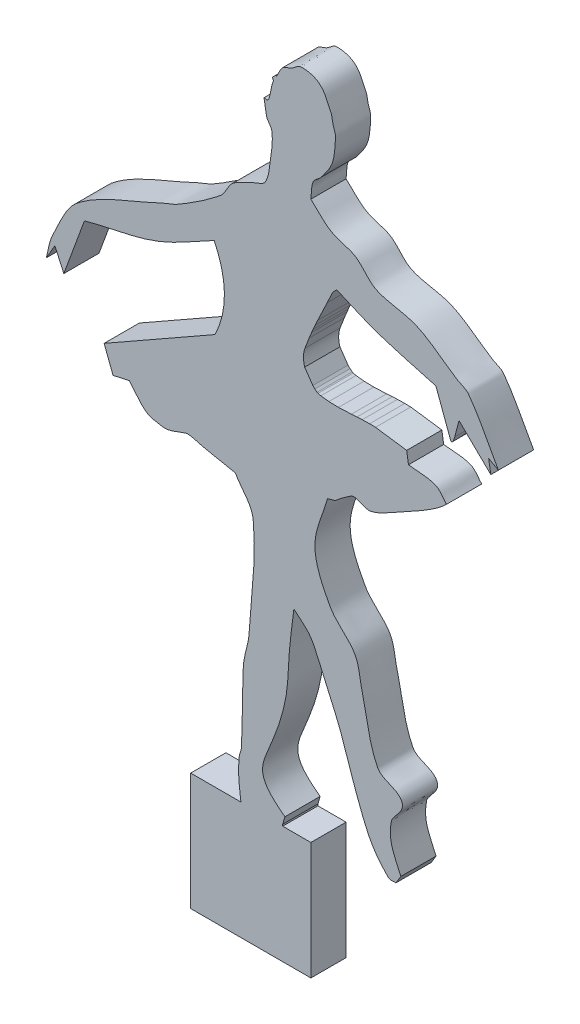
ISO-10303-21;
HEADER;
FILE_DESCRIPTION(('STEP AP214'),'2;1');
FILE_NAME('part.step','',(''),(''),'','','');
FILE_SCHEMA(('AUTOMOTIVE_DESIGN { 1 0 10303 214 1 1 1 1 }'));
ENDSEC;
DATA;
#1=APPLICATION_CONTEXT('core data for automotive mechanical design processes');
#2=APPLICATION_PROTOCOL_DEFINITION('international standard','automotive_design',2000,#1);
#3=PRODUCT_CONTEXT('',#1,'mechanical');
#4=PRODUCT('Part','Part','',(#3));
#5=PRODUCT_RELATED_PRODUCT_CATEGORY('part','',(#4));
#6=PRODUCT_DEFINITION_FORMATION('','',#4);
#7=PRODUCT_DEFINITION_CONTEXT('part definition',#1,'design');
#8=PRODUCT_DEFINITION('design','',#6,#7);
#9=PRODUCT_DEFINITION_SHAPE('','',#8);
#10=(LENGTH_UNIT() NAMED_UNIT(*) SI_UNIT(.MILLI.,.METRE.));
#11=(NAMED_UNIT(*) PLANE_ANGLE_UNIT() SI_UNIT($,.RADIAN.));
#12=(NAMED_UNIT(*) SI_UNIT($,.STERADIAN.) SOLID_ANGLE_UNIT());
#13=UNCERTAINTY_MEASURE_WITH_UNIT(LENGTH_MEASURE(1.E-05),#10,'distance_accuracy_value','');
#14=(GEOMETRIC_REPRESENTATION_CONTEXT(3) GLOBAL_UNCERTAINTY_ASSIGNED_CONTEXT((#13)) GLOBAL_UNIT_ASSIGNED_CONTEXT((#10,
#11,#12)) REPRESENTATION_CONTEXT('',''));
#15=CARTESIAN_POINT('',(0.,0.,0.));
#16=DIRECTION('',(0.,0.,1.));
#17=DIRECTION('',(1.,0.,0.));
#18=AXIS2_PLACEMENT_3D('',#15,#16,#17);
#19=CARTESIAN_POINT('',(1086.05669320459,-9982.74711407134,3.));
#20=CARTESIAN_POINT('',(1085.83406010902,-9982.00139847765,3.));
#21=CARTESIAN_POINT('',(1086.08047796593,-9981.33717508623,3.));
#22=B_SPLINE_CURVE_WITH_KNOTS('',2,(#19,#20,#21),.UNSPECIFIED.,.F.,.F.,(3,3),(0.,1.),.UNSPECIFIED.);
#23=DIRECTION('',(0.,0.,-1.));
#24=VECTOR('',#23,1.);
#25=SURFACE_OF_LINEAR_EXTRUSION('',#22,#24);
#26=CARTESIAN_POINT('',(1086.05669320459,-9982.74711407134,0.));
#27=CARTESIAN_POINT('',(1085.83406010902,-9982.00139847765,0.));
#28=CARTESIAN_POINT('',(1086.08047796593,-9981.33717508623,0.));
#29=B_SPLINE_CURVE_WITH_KNOTS('',2,(#26,#27,#28),.UNSPECIFIED.,.F.,.F.,(3,3),(0.,1.),.UNSPECIFIED.);
#30=CARTESIAN_POINT('',(1086.05669320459,-9982.74711407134,0.));
#31=VERTEX_POINT('',#30);
#32=CARTESIAN_POINT('',(1086.08047796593,-9981.33717508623,0.));
#33=VERTEX_POINT('',#32);
#34=EDGE_CURVE('E477',#31,#33,#29,.T.);
#35=ORIENTED_EDGE('',*,*,#34,.T.);
#36=DIRECTION('',(0.,0.,-1.));
#37=VECTOR('',#36,1.);
#38=CARTESIAN_POINT('',(1086.08047796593,-9981.33717508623,3.));
#39=LINE('',#38,#37);
#40=CARTESIAN_POINT('',(1086.08047796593,-9981.33717508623,3.));
#41=VERTEX_POINT('',#40);
#42=EDGE_CURVE('E11',#41,#33,#39,.T.);
#43=ORIENTED_EDGE('',*,*,#42,.F.);
#44=CARTESIAN_POINT('',(1086.05669320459,-9982.74711407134,3.));
#45=VERTEX_POINT('',#44);
#46=EDGE_CURVE('E776',#45,#41,#22,.T.);
#47=ORIENTED_EDGE('',*,*,#46,.F.);
#48=DIRECTION('',(0.,0.,-1.));
#49=VECTOR('',#48,1.);
#50=CARTESIAN_POINT('',(1086.05669320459,-9982.74711407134,3.));
#51=LINE('',#50,#49);
#52=EDGE_CURVE('E473',#45,#31,#51,.T.);
#53=ORIENTED_EDGE('',*,*,#52,.T.);
#54=EDGE_LOOP('',(#35,#43,#47,#53));
#55=FACE_BOUND('',#54,.T.);
#56=ADVANCED_FACE('F45',(#55),#25,.F.);
#57=CARTESIAN_POINT('',(4272.01790787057,-1629.65814471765,3.));
#58=DIRECTION('',(-0.934325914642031,0.356419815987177,0.));
#59=DIRECTION('',(-0.356419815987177,-0.934325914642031,0.));
#60=AXIS2_PLACEMENT_3D('',#57,#58,#59);
#61=PLANE('',#60);
#62=DIRECTION('',(0.356419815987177,0.934325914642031,0.));
#63=VECTOR('',#62,1.);
#64=CARTESIAN_POINT('',(4272.01790787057,-1629.65814471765,0.));
#65=LINE('',#64,#63);
#66=CARTESIAN_POINT('',(1086.43100838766,-9980.41828774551,0.));
#67=VERTEX_POINT('',#66);
#68=EDGE_CURVE('E483',#33,#67,#65,.T.);
#69=ORIENTED_EDGE('',*,*,#68,.T.);
#70=DIRECTION('',(0.,0.,-1.));
#71=VECTOR('',#70,1.);
#72=CARTESIAN_POINT('',(1086.43100838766,-9980.41828774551,3.));
#73=LINE('',#72,#71);
#74=CARTESIAN_POINT('',(1086.43100838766,-9980.41828774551,3.));
#75=VERTEX_POINT('',#74);
#76=EDGE_CURVE('E55',#75,#67,#73,.T.);
#77=ORIENTED_EDGE('',*,*,#76,.F.);
#78=DIRECTION('',(0.356419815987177,0.934325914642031,0.));
#79=VECTOR('',#78,1.);
#80=CARTESIAN_POINT('',(4272.01790787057,-1629.65814471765,3.));
#81=LINE('',#80,#79);
#82=EDGE_CURVE('E271',#41,#75,#81,.T.);
#83=ORIENTED_EDGE('',*,*,#82,.F.);
#84=ORIENTED_EDGE('',*,*,#42,.T.);
#85=EDGE_LOOP('',(#69,#77,#83,#84));
#86=FACE_BOUND('',#85,.T.);
#87=ADVANCED_FACE('F1064',(#86),#61,.F.);
#88=CARTESIAN_POINT('',(4468.46035354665,-1861.3557986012,3.));
#89=DIRECTION('',(-0.923113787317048,0.384526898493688,0.));
#90=DIRECTION('',(-0.384526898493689,-0.923113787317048,0.));
#91=AXIS2_PLACEMENT_3D('',#88,#89,#90);
#92=PLANE('',#91);
#93=DIRECTION('',(0.384526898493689,0.923113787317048,0.));
#94=VECTOR('',#93,1.);
#95=CARTESIAN_POINT('',(4468.46035354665,-1861.3557986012,0.));
#96=LINE('',#95,#94);
#97=CARTESIAN_POINT('',(1086.65878604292,-9979.87147373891,0.));
#98=VERTEX_POINT('',#97);
#99=EDGE_CURVE('E489',#67,#98,#96,.T.);
#100=ORIENTED_EDGE('',*,*,#99,.T.);
#101=DIRECTION('',(0.,0.,-1.));
#102=VECTOR('',#101,1.);
#103=CARTESIAN_POINT('',(1086.65878604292,-9979.87147373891,3.));
#104=LINE('',#103,#102);
#105=CARTESIAN_POINT('',(1086.65878604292,-9979.87147373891,3.));
#106=VERTEX_POINT('',#105);
#107=EDGE_CURVE('E967',#106,#98,#104,.T.);
#108=ORIENTED_EDGE('',*,*,#107,.F.);
#109=DIRECTION('',(0.384526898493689,0.923113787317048,0.));
#110=VECTOR('',#109,1.);
#111=CARTESIAN_POINT('',(4468.46035354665,-1861.3557986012,3.));
#112=LINE('',#111,#110);
#113=EDGE_CURVE('E977',#75,#106,#112,.T.);
#114=ORIENTED_EDGE('',*,*,#113,.F.);
#115=ORIENTED_EDGE('',*,*,#76,.T.);
#116=EDGE_LOOP('',(#100,#108,#114,#115));
#117=FACE_BOUND('',#116,.T.);
#118=ADVANCED_FACE('F975',(#117),#92,.F.);
#119=CARTESIAN_POINT('',(4556.15858876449,-1974.66338877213,3.));
#120=DIRECTION('',(-0.917531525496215,0.397663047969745,0.));
#121=DIRECTION('',(-0.397663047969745,-0.917531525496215,0.));
#122=AXIS2_PLACEMENT_3D('',#119,#120,#121);
#123=PLANE('',#122);
#124=DIRECTION('',(0.397663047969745,0.917531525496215,0.));
#125=VECTOR('',#124,1.);
#126=CARTESIAN_POINT('',(4556.15858876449,-1974.66338877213,0.));
#127=LINE('',#126,#125);
#128=CARTESIAN_POINT('',(1086.78498045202,-9979.58030424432,0.));
#129=VERTEX_POINT('',#128);
#130=EDGE_CURVE('E492',#98,#129,#127,.T.);
#131=ORIENTED_EDGE('',*,*,#130,.T.);
#132=DIRECTION('',(0.,0.,-1.));
#133=VECTOR('',#132,1.);
#134=CARTESIAN_POINT('',(1086.78498045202,-9979.58030424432,3.));
#135=LINE('',#134,#133);
#136=CARTESIAN_POINT('',(1086.78498045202,-9979.58030424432,3.));
#137=VERTEX_POINT('',#136);
#138=EDGE_CURVE('E963',#137,#129,#135,.T.);
#139=ORIENTED_EDGE('',*,*,#138,.F.);
#140=DIRECTION('',(0.397663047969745,0.917531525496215,0.));
#141=VECTOR('',#140,1.);
#142=CARTESIAN_POINT('',(4556.15858876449,-1974.66338877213,3.));
#143=LINE('',#142,#141);
#144=EDGE_CURVE('E996',#106,#137,#143,.T.);
#145=ORIENTED_EDGE('',*,*,#144,.F.);
#146=ORIENTED_EDGE('',*,*,#107,.T.);
#147=EDGE_LOOP('',(#131,#139,#145,#146));
#148=FACE_BOUND('',#147,.T.);
#149=ADVANCED_FACE('F986',(#148),#123,.F.);
#150=CARTESIAN_POINT('',(4612.54164428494,-2051.20097997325,3.));
#151=DIRECTION('',(-0.913724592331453,0.406334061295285,0.));
#152=DIRECTION('',(-0.406334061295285,-0.913724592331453,0.));
#153=AXIS2_PLACEMENT_3D('',#150,#151,#152);
#154=PLANE('',#153);
#155=DIRECTION('',(0.406334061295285,0.913724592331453,0.));
#156=VECTOR('',#155,1.);
#157=CARTESIAN_POINT('',(4612.54164428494,-2051.20097997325,0.));
#158=LINE('',#157,#156);
#159=CARTESIAN_POINT('',(1086.94603281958,-9979.21814531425,0.));
#160=VERTEX_POINT('',#159);
#161=EDGE_CURVE('E495',#129,#160,#158,.T.);
#162=ORIENTED_EDGE('',*,*,#161,.T.);
#163=DIRECTION('',(0.,0.,-1.));
#164=VECTOR('',#163,1.);
#165=CARTESIAN_POINT('',(1086.94603281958,-9979.21814531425,3.));
#166=LINE('',#165,#164);
#167=CARTESIAN_POINT('',(1086.94603281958,-9979.21814531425,3.));
#168=VERTEX_POINT('',#167);
#169=EDGE_CURVE('E959',#168,#160,#166,.T.);
#170=ORIENTED_EDGE('',*,*,#169,.F.);
#171=DIRECTION('',(0.406334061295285,0.913724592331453,0.));
#172=VECTOR('',#171,1.);
#173=CARTESIAN_POINT('',(4612.54164428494,-2051.20097997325,3.));
#174=LINE('',#173,#172);
#175=EDGE_CURVE('E992',#137,#168,#174,.T.);
#176=ORIENTED_EDGE('',*,*,#175,.F.);
#177=ORIENTED_EDGE('',*,*,#138,.T.);
#178=EDGE_LOOP('',(#162,#170,#176,#177));
#179=FACE_BOUND('',#178,.T.);
#180=ADVANCED_FACE('F990',(#179),#154,.F.);
#181=CARTESIAN_POINT('',(4671.40189854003,-2134.47952015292,3.));
#182=DIRECTION('',(-0.909549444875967,0.41559572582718,0.));
#183=DIRECTION('',(-0.41559572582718,-0.909549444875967,0.));
#184=AXIS2_PLACEMENT_3D('',#181,#182,#183);
#185=PLANE('',#184);
#186=DIRECTION('',(0.41559572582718,0.909549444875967,0.));
#187=VECTOR('',#186,1.);
#188=CARTESIAN_POINT('',(4671.40189854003,-2134.47952015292,0.));
#189=LINE('',#188,#187);
#190=CARTESIAN_POINT('',(1087.16605148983,-9978.7366248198,0.));
#191=VERTEX_POINT('',#190);
#192=EDGE_CURVE('E498',#160,#191,#189,.T.);
#193=ORIENTED_EDGE('',*,*,#192,.T.);
#194=DIRECTION('',(0.,0.,-1.));
#195=VECTOR('',#194,1.);
#196=CARTESIAN_POINT('',(1087.16605148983,-9978.7366248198,3.));
#197=LINE('',#196,#195);
#198=CARTESIAN_POINT('',(1087.16605148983,-9978.7366248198,3.));
#199=VERTEX_POINT('',#198);
#200=EDGE_CURVE('E955',#199,#191,#197,.T.);
#201=ORIENTED_EDGE('',*,*,#200,.F.);
#202=DIRECTION('',(0.41559572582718,0.909549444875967,0.));
#203=VECTOR('',#202,1.);
#204=CARTESIAN_POINT('',(4671.40189854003,-2134.47952015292,3.));
#205=LINE('',#204,#203);
#206=EDGE_CURVE('E995',#168,#199,#205,.T.);
#207=ORIENTED_EDGE('',*,*,#206,.F.);
#208=ORIENTED_EDGE('',*,*,#169,.T.);
#209=EDGE_LOOP('',(#193,#201,#207,#208));
#210=FACE_BOUND('',#209,.T.);
#211=ADVANCED_FACE('F1054',(#210),#185,.F.);
#212=CARTESIAN_POINT('',(4750.09492568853,-2251.75323749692,3.));
#213=DIRECTION('',(-0.903612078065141,0.42835173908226,0.));
#214=DIRECTION('',(-0.428351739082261,-0.903612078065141,0.));
#215=AXIS2_PLACEMENT_3D('',#212,#213,#214);
#216=PLANE('',#215);
#217=DIRECTION('',(0.428351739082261,0.903612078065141,0.));
#218=VECTOR('',#217,1.);
#219=CARTESIAN_POINT('',(4750.09492568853,-2251.75323749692,0.));
#220=LINE('',#219,#218);
#221=CARTESIAN_POINT('',(1087.97379349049,-9977.03268536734,0.));
#222=VERTEX_POINT('',#221);
#223=EDGE_CURVE('E501',#191,#222,#220,.T.);
#224=ORIENTED_EDGE('',*,*,#223,.T.);
#225=DIRECTION('',(0.,0.,-1.));
#226=VECTOR('',#225,1.);
#227=CARTESIAN_POINT('',(1087.97379349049,-9977.03268536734,3.));
#228=LINE('',#227,#226);
#229=CARTESIAN_POINT('',(1087.97379349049,-9977.03268536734,3.));
#230=VERTEX_POINT('',#229);
#231=EDGE_CURVE('E951',#230,#222,#228,.T.);
#232=ORIENTED_EDGE('',*,*,#231,.F.);
#233=DIRECTION('',(0.428351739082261,0.903612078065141,0.));
#234=VECTOR('',#233,1.);
#235=CARTESIAN_POINT('',(4750.09492568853,-2251.75323749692,3.));
#236=LINE('',#235,#234);
#237=EDGE_CURVE('E1000',#199,#230,#236,.T.);
#238=ORIENTED_EDGE('',*,*,#237,.F.);
#239=ORIENTED_EDGE('',*,*,#200,.T.);
#240=EDGE_LOOP('',(#224,#232,#238,#239));
#241=FACE_BOUND('',#240,.T.);
#242=ADVANCED_FACE('F1050',(#241),#216,.F.);
#243=CARTESIAN_POINT('',(4739.24415694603,-2235.1486654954,3.));
#244=DIRECTION('',(-0.90445691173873,0.42656499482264,0.));
#245=DIRECTION('',(-0.42656499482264,-0.90445691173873,0.));
#246=AXIS2_PLACEMENT_3D('',#243,#244,#245);
#247=PLANE('',#246);
#248=DIRECTION('',(0.42656499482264,0.90445691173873,0.));
#249=VECTOR('',#248,1.);
#250=CARTESIAN_POINT('',(4739.24415694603,-2235.1486654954,0.));
#251=LINE('',#250,#249);
#252=CARTESIAN_POINT('',(1088.46233679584,-9975.99681422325,0.));
#253=VERTEX_POINT('',#252);
#254=EDGE_CURVE('E504',#222,#253,#251,.T.);
#255=ORIENTED_EDGE('',*,*,#254,.T.);
#256=DIRECTION('',(0.,0.,-1.));
#257=VECTOR('',#256,1.);
#258=CARTESIAN_POINT('',(1088.46233679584,-9975.99681422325,3.));
#259=LINE('',#258,#257);
#260=CARTESIAN_POINT('',(1088.46233679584,-9975.99681422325,3.));
#261=VERTEX_POINT('',#260);
#262=EDGE_CURVE('E947',#261,#253,#259,.T.);
#263=ORIENTED_EDGE('',*,*,#262,.F.);
#264=DIRECTION('',(0.42656499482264,0.90445691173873,0.));
#265=VECTOR('',#264,1.);
#266=CARTESIAN_POINT('',(4739.24415694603,-2235.1486654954,3.));
#267=LINE('',#266,#265);
#268=EDGE_CURVE('E1007',#230,#261,#267,.T.);
#269=ORIENTED_EDGE('',*,*,#268,.F.);
#270=ORIENTED_EDGE('',*,*,#231,.T.);
#271=EDGE_LOOP('',(#255,#263,#269,#270));
#272=FACE_BOUND('',#271,.T.);
#273=ADVANCED_FACE('F1046',(#272),#247,.F.);
#274=CARTESIAN_POINT('',(5493.01110313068,-5816.18487862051,3.));
#275=DIRECTION('',(-0.686620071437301,0.727016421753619,0.));
#276=DIRECTION('',(-0.727016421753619,-0.686620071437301,0.));
#277=AXIS2_PLACEMENT_3D('',#274,#275,#276);
#278=PLANE('',#277);
#279=DIRECTION('',(0.727016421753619,0.686620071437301,0.));
#280=VECTOR('',#279,1.);
#281=CARTESIAN_POINT('',(5493.01110313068,-5816.18487862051,0.));
#282=LINE('',#281,#280);
#283=CARTESIAN_POINT('',(1088.80042574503,-9975.67751103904,0.));
#284=VERTEX_POINT('',#283);
#285=EDGE_CURVE('E507',#253,#284,#282,.T.);
#286=ORIENTED_EDGE('',*,*,#285,.T.);
#287=DIRECTION('',(0.,0.,-1.));
#288=VECTOR('',#287,1.);
#289=CARTESIAN_POINT('',(1088.80042574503,-9975.67751103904,3.));
#290=LINE('',#289,#288);
#291=CARTESIAN_POINT('',(1088.80042574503,-9975.67751103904,3.));
#292=VERTEX_POINT('',#291);
#293=EDGE_CURVE('E944',#292,#284,#290,.T.);
#294=ORIENTED_EDGE('',*,*,#293,.F.);
#295=DIRECTION('',(0.727016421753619,0.686620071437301,0.));
#296=VECTOR('',#295,1.);
#297=CARTESIAN_POINT('',(5493.01110313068,-5816.18487862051,3.));
#298=LINE('',#297,#296);
#299=EDGE_CURVE('E1010',#261,#292,#298,.T.);
#300=ORIENTED_EDGE('',*,*,#299,.F.);
#301=ORIENTED_EDGE('',*,*,#262,.T.);
#302=EDGE_LOOP('',(#286,#294,#300,#301));
#303=FACE_BOUND('',#302,.T.);
#304=ADVANCED_FACE('F1043',(#303),#278,.F.);
#305=CARTESIAN_POINT('',(1097.23421597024,-9978.54701607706,3.));
#306=CARTESIAN_POINT('',(1095.56927651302,-9978.06405653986,3.));
#307=CARTESIAN_POINT('',(1093.87647946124,-9977.66843237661,3.));
#308=CARTESIAN_POINT('',(1092.23939759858,-9977.09813746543,3.));
#309=CARTESIAN_POINT('',(1091.0680690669,-9976.69009269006,3.));
#310=CARTESIAN_POINT('',(1089.93832600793,-9976.17311831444,3.));
#311=CARTESIAN_POINT('',(1088.80042574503,-9975.67751103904,3.));
#312=B_SPLINE_CURVE_WITH_KNOTS('',3,(#305,#306,#307,#308,#309,#310,#311),.UNSPECIFIED.,.F.,.F.,
(4,3,4),(0.,1.,1.79743675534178),.UNSPECIFIED.);
#313=DIRECTION('',(0.,0.,-1.));
#314=VECTOR('',#313,1.);
#315=SURFACE_OF_LINEAR_EXTRUSION('',#312,#314);
#316=CARTESIAN_POINT('',(1097.23421597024,-9978.54701607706,0.));
#317=CARTESIAN_POINT('',(1095.56927651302,-9978.06405653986,0.));
#318=CARTESIAN_POINT('',(1093.87647946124,-9977.66843237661,0.));
#319=CARTESIAN_POINT('',(1092.23939759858,-9977.09813746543,0.));
#320=CARTESIAN_POINT('',(1091.0680690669,-9976.69009269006,0.));
#321=CARTESIAN_POINT('',(1089.93832600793,-9976.17311831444,0.));
#322=CARTESIAN_POINT('',(1088.80042574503,-9975.67751103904,0.));
#323=B_SPLINE_CURVE_WITH_KNOTS('',3,(#316,#317,#318,#319,#320,#321,#322),.UNSPECIFIED.,.F.,.F.,
(4,3,4),(0.,1.,1.79743675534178),.UNSPECIFIED.);
#324=CARTESIAN_POINT('',(1092.83529636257,-9977.29773343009,0.));
#325=VERTEX_POINT('',#324);
#326=EDGE_CURVE('E511',#325,#284,#323,.T.);
#327=ORIENTED_EDGE('',*,*,#326,.F.);
#328=DIRECTION('',(0.,0.,-1.));
#329=VECTOR('',#328,1.);
#330=CARTESIAN_POINT('',(1092.83529636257,-9977.29773343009,3.));
#331=LINE('',#330,#329);
#332=CARTESIAN_POINT('',(1092.83529636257,-9977.29773343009,3.));
#333=VERTEX_POINT('',#332);
#334=EDGE_CURVE('E941',#333,#325,#331,.T.);
#335=ORIENTED_EDGE('',*,*,#334,.F.);
#336=EDGE_CURVE('E1013',#333,#292,#312,.T.);
#337=ORIENTED_EDGE('',*,*,#336,.T.);
#338=ORIENTED_EDGE('',*,*,#293,.T.);
#339=EDGE_LOOP('',(#327,#335,#337,#338));
#340=FACE_BOUND('',#339,.T.);
#341=ADVANCED_FACE('F1034',(#340),#315,.T.);
#342=CARTESIAN_POINT('',(-2627.02116952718,-8876.3828894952,3.));
#343=DIRECTION('',(0.283788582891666,0.958886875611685,0.));
#344=DIRECTION('',(-0.958886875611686,0.283788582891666,0.));
#345=AXIS2_PLACEMENT_3D('',#342,#343,#344);
#346=PLANE('',#345);
#347=DIRECTION('',(0.958886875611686,-0.283788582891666,0.));
#348=VECTOR('',#347,1.);
#349=CARTESIAN_POINT('',(-2627.02116952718,-8876.3828894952,0.));
#350=LINE('',#349,#348);
#351=CARTESIAN_POINT('',(1094.61989252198,-9977.82589585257,0.));
#352=VERTEX_POINT('',#351);
#353=EDGE_CURVE('E517',#325,#352,#350,.T.);
#354=ORIENTED_EDGE('',*,*,#353,.T.);
#355=DIRECTION('',(0.,0.,-1.));
#356=VECTOR('',#355,1.);
#357=CARTESIAN_POINT('',(1094.61989252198,-9977.82589585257,3.));
#358=LINE('',#357,#356);
#359=CARTESIAN_POINT('',(1094.61989252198,-9977.82589585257,3.));
#360=VERTEX_POINT('',#359);
#361=EDGE_CURVE('E937',#360,#352,#358,.T.);
#362=ORIENTED_EDGE('',*,*,#361,.F.);
#363=DIRECTION('',(0.958886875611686,-0.283788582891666,0.));
#364=VECTOR('',#363,1.);
#365=CARTESIAN_POINT('',(-2627.02116952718,-8876.3828894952,3.));
#366=LINE('',#365,#364);
#367=EDGE_CURVE('E1020',#333,#360,#366,.T.);
#368=ORIENTED_EDGE('',*,*,#367,.F.);
#369=ORIENTED_EDGE('',*,*,#334,.T.);
#370=EDGE_LOOP('',(#354,#362,#368,#369));
#371=FACE_BOUND('',#370,.T.);
#372=ADVANCED_FACE('F1038',(#371),#346,.F.);
#373=CARTESIAN_POINT('',(-2457.14440338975,-9009.11874366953,3.));
#374=DIRECTION('',(0.26312857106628,0.964760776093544,0.));
#375=DIRECTION('',(-0.964760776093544,0.26312857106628,0.));
#376=AXIS2_PLACEMENT_3D('',#373,#374,#375);
#377=PLANE('',#376);
#378=DIRECTION('',(0.964760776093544,-0.26312857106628,0.));
#379=VECTOR('',#378,1.);
#380=CARTESIAN_POINT('',(-2457.14440338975,-9009.11874366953,0.));
#381=LINE('',#380,#379);
#382=CARTESIAN_POINT('',(1095.7689694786,-9978.13929476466,0.));
#383=VERTEX_POINT('',#382);
#384=EDGE_CURVE('E524',#352,#383,#381,.T.);
#385=ORIENTED_EDGE('',*,*,#384,.T.);
#386=DIRECTION('',(0.,0.,-1.));
#387=VECTOR('',#386,1.);
#388=CARTESIAN_POINT('',(1095.7689694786,-9978.13929476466,3.));
#389=LINE('',#388,#387);
#390=CARTESIAN_POINT('',(1095.7689694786,-9978.13929476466,3.));
#391=VERTEX_POINT('',#390);
#392=EDGE_CURVE('E934',#391,#383,#389,.T.);
#393=ORIENTED_EDGE('',*,*,#392,.F.);
#394=DIRECTION('',(0.964760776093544,-0.26312857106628,0.));
#395=VECTOR('',#394,1.);
#396=CARTESIAN_POINT('',(-2457.14440338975,-9009.11874366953,3.));
#397=LINE('',#396,#395);
#398=EDGE_CURVE('E1354',#360,#391,#397,.T.);
#399=ORIENTED_EDGE('',*,*,#398,.F.);
#400=ORIENTED_EDGE('',*,*,#361,.T.);
#401=EDGE_LOOP('',(#385,#393,#399,#400));
#402=FACE_BOUND('',#401,.T.);
#403=ADVANCED_FACE('F1032',(#402),#377,.F.);
#404=CARTESIAN_POINT('',(1097.23421597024,-9978.54701607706,0.));
#405=VERTEX_POINT('',#404);
#406=EDGE_CURVE('E518',#405,#383,#323,.T.);
#407=ORIENTED_EDGE('',*,*,#406,.F.);
#408=DIRECTION('',(0.,0.,-1.));
#409=VECTOR('',#408,1.);
#410=CARTESIAN_POINT('',(1097.23421597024,-9978.54701607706,3.));
#411=LINE('',#410,#409);
#412=CARTESIAN_POINT('',(1097.23421597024,-9978.54701607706,3.));
#413=VERTEX_POINT('',#412);
#414=EDGE_CURVE('E931',#413,#405,#411,.T.);
#415=ORIENTED_EDGE('',*,*,#414,.F.);
#416=EDGE_CURVE('E1021',#413,#391,#312,.T.);
#417=ORIENTED_EDGE('',*,*,#416,.T.);
#418=ORIENTED_EDGE('',*,*,#392,.T.);
#419=EDGE_LOOP('',(#407,#415,#417,#418));
#420=FACE_BOUND('',#419,.T.);
#421=ADVANCED_FACE('F1027',(#420),#315,.T.);
#422=CARTESIAN_POINT('',(-2295.66199298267,-853.586471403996,3.));
#423=DIRECTION('',(-0.937303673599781,-0.348513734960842,0.));
#424=DIRECTION('',(0.348513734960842,-0.937303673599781,0.));
#425=AXIS2_PLACEMENT_3D('',#422,#423,#424);
#426=PLANE('',#425);
#427=DIRECTION('',(-0.348513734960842,0.937303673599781,0.));
#428=VECTOR('',#427,1.);
#429=CARTESIAN_POINT('',(-2295.66199298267,-853.586471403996,0.));
#430=LINE('',#429,#428);
#431=CARTESIAN_POINT('',(1098.48307460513,-9981.90573531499,0.));
#432=VERTEX_POINT('',#431);
#433=EDGE_CURVE('E528',#432,#405,#430,.T.);
#434=ORIENTED_EDGE('',*,*,#433,.F.);
#435=DIRECTION('',(0.,0.,-1.));
#436=VECTOR('',#435,1.);
#437=CARTESIAN_POINT('',(1098.48307460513,-9981.90573531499,3.));
#438=LINE('',#437,#436);
#439=CARTESIAN_POINT('',(1098.48307460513,-9981.90573531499,3.));
#440=VERTEX_POINT('',#439);
#441=EDGE_CURVE('E928',#440,#432,#438,.T.);
#442=ORIENTED_EDGE('',*,*,#441,.F.);
#443=DIRECTION('',(-0.348513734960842,0.937303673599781,0.));
#444=VECTOR('',#443,1.);
#445=CARTESIAN_POINT('',(-2295.66199298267,-853.586471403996,3.));
#446=LINE('',#445,#444);
#447=EDGE_CURVE('E1334',#440,#413,#446,.T.);
#448=ORIENTED_EDGE('',*,*,#447,.T.);
#449=ORIENTED_EDGE('',*,*,#414,.T.);
#450=EDGE_LOOP('',(#434,#442,#448,#449));
#451=FACE_BOUND('',#450,.T.);
#452=ADVANCED_FACE('F1031',(#451),#426,.T.);
#453=CARTESIAN_POINT('',(1098.48307460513,-9981.90573531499,3.));
#454=CARTESIAN_POINT('',(1098.59365360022,-9982.0964100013,3.));
#455=CARTESIAN_POINT('',(1098.71305130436,-9981.95933584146,3.));
#456=CARTESIAN_POINT('',(1098.84126771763,-9981.49451283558,3.));
#457=B_SPLINE_CURVE_WITH_KNOTS('',3,(#453,#454,#455,#456),.UNSPECIFIED.,.F.,.F.,(4,4),
(0.232918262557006,1.),.UNSPECIFIED.);
#458=DIRECTION('',(0.,0.,-1.));
#459=VECTOR('',#458,1.);
#460=SURFACE_OF_LINEAR_EXTRUSION('',#457,#459);
#461=CARTESIAN_POINT('',(1098.48307460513,-9981.90573531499,0.));
#462=CARTESIAN_POINT('',(1098.59365360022,-9982.0964100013,0.));
#463=CARTESIAN_POINT('',(1098.71305130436,-9981.95933584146,0.));
#464=CARTESIAN_POINT('',(1098.84126771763,-9981.49451283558,0.));
#465=B_SPLINE_CURVE_WITH_KNOTS('',3,(#461,#462,#463,#464),.UNSPECIFIED.,.F.,.F.,(4,4),
(0.232918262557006,1.),.UNSPECIFIED.);
#466=CARTESIAN_POINT('',(1098.84126771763,-9981.49451283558,0.));
#467=VERTEX_POINT('',#466);
#468=EDGE_CURVE('E532',#432,#467,#465,.T.);
#469=ORIENTED_EDGE('',*,*,#468,.T.);
#470=DIRECTION('',(0.,0.,-1.));
#471=VECTOR('',#470,1.);
#472=CARTESIAN_POINT('',(1098.84126771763,-9981.49451283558,3.));
#473=LINE('',#472,#471);
#474=CARTESIAN_POINT('',(1098.84126771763,-9981.49451283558,3.));
#475=VERTEX_POINT('',#474);
#476=EDGE_CURVE('E925',#475,#467,#473,.T.);
#477=ORIENTED_EDGE('',*,*,#476,.F.);
#478=EDGE_CURVE('E1374',#440,#475,#457,.T.);
#479=ORIENTED_EDGE('',*,*,#478,.F.);
#480=ORIENTED_EDGE('',*,*,#441,.T.);
#481=EDGE_LOOP('',(#469,#477,#479,#480));
#482=FACE_BOUND('',#481,.T.);
#483=ADVANCED_FACE('F1385',(#482),#460,.F.);
#484=CARTESIAN_POINT('',(3500.59528734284,-928.729361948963,3.));
#485=DIRECTION('',(0.966561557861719,-0.256434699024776,0.));
#486=DIRECTION('',(0.256434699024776,0.966561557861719,0.));
#487=AXIS2_PLACEMENT_3D('',#484,#485,#486);
#488=PLANE('',#487);
#489=DIRECTION('',(-0.256434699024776,-0.966561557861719,0.));
#490=VECTOR('',#489,1.);
#491=CARTESIAN_POINT('',(3500.59528734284,-928.729361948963,0.));
#492=LINE('',#491,#490);
#493=CARTESIAN_POINT('',(1099.20692781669,-9980.11625553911,0.));
#494=VERTEX_POINT('',#493);
#495=EDGE_CURVE('E538',#494,#467,#492,.T.);
#496=ORIENTED_EDGE('',*,*,#495,.F.);
#497=DIRECTION('',(0.,0.,-1.));
#498=VECTOR('',#497,1.);
#499=CARTESIAN_POINT('',(1099.20692781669,-9980.11625553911,3.));
#500=LINE('',#499,#498);
#501=CARTESIAN_POINT('',(1099.20692781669,-9980.11625553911,3.));
#502=VERTEX_POINT('',#501);
#503=EDGE_CURVE('E922',#502,#494,#500,.T.);
#504=ORIENTED_EDGE('',*,*,#503,.F.);
#505=DIRECTION('',(-0.256434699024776,-0.966561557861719,0.));
#506=VECTOR('',#505,1.);
#507=CARTESIAN_POINT('',(3500.59528734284,-928.729361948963,3.));
#508=LINE('',#507,#506);
#509=EDGE_CURVE('E1380',#502,#475,#508,.T.);
#510=ORIENTED_EDGE('',*,*,#509,.T.);
#511=ORIENTED_EDGE('',*,*,#476,.T.);
#512=EDGE_LOOP('',(#496,#504,#510,#511));
#513=FACE_BOUND('',#512,.T.);
#514=ADVANCED_FACE('F1323',(#513),#488,.T.);
#515=CARTESIAN_POINT('',(-4454.11807310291,-4583.22294479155,3.));
#516=DIRECTION('',(-0.696934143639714,-0.717135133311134,0.));
#517=DIRECTION('',(0.717135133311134,-0.696934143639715,0.));
#518=AXIS2_PLACEMENT_3D('',#515,#516,#517);
#519=PLANE('',#518);
#520=DIRECTION('',(-0.717135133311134,0.696934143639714,0.));
#521=VECTOR('',#520,1.);
#522=CARTESIAN_POINT('',(-4454.11807310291,-4583.22294479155,0.));
#523=LINE('',#522,#521);
#524=CARTESIAN_POINT('',(1101.91404311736,-9982.74711407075,0.));
#525=VERTEX_POINT('',#524);
#526=EDGE_CURVE('E545',#525,#494,#523,.T.);
#527=ORIENTED_EDGE('',*,*,#526,.F.);
#528=DIRECTION('',(0.,0.,-1.));
#529=VECTOR('',#528,1.);
#530=CARTESIAN_POINT('',(1101.91404311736,-9982.74711407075,3.));
#531=LINE('',#530,#529);
#532=CARTESIAN_POINT('',(1101.91404311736,-9982.74711407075,3.));
#533=VERTEX_POINT('',#532);
#534=EDGE_CURVE('E919',#533,#525,#531,.T.);
#535=ORIENTED_EDGE('',*,*,#534,.F.);
#536=DIRECTION('',(-0.717135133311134,0.696934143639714,0.));
#537=VECTOR('',#536,1.);
#538=CARTESIAN_POINT('',(-4454.11807310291,-4583.22294479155,3.));
#539=LINE('',#538,#537);
#540=EDGE_CURVE('E1319',#533,#502,#539,.T.);
#541=ORIENTED_EDGE('',*,*,#540,.T.);
#542=ORIENTED_EDGE('',*,*,#503,.T.);
#543=EDGE_LOOP('',(#527,#535,#541,#542));
#544=FACE_BOUND('',#543,.T.);
#545=ADVANCED_FACE('F1317',(#544),#519,.T.);
#546=CARTESIAN_POINT('',(-546.691273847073,-91.1152123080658,3.));
#547=DIRECTION('',(0.986393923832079,0.164398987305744,0.));
#548=DIRECTION('',(-0.164398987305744,0.986393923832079,0.));
#549=AXIS2_PLACEMENT_3D('',#546,#547,#548);
#550=PLANE('',#549);
#551=DIRECTION('',(0.164398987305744,-0.986393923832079,0.));
#552=VECTOR('',#551,1.);
#553=CARTESIAN_POINT('',(-546.691273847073,-91.1152123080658,0.));
#554=LINE('',#553,#552);
#555=CARTESIAN_POINT('',(1101.73039334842,-9981.64521545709,0.));
#556=VERTEX_POINT('',#555);
#557=EDGE_CURVE('E549',#556,#525,#554,.T.);
#558=ORIENTED_EDGE('',*,*,#557,.F.);
#559=DIRECTION('',(0.,0.,-1.));
#560=VECTOR('',#559,1.);
#561=CARTESIAN_POINT('',(1101.73039334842,-9981.64521545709,3.));
#562=LINE('',#561,#560);
#563=CARTESIAN_POINT('',(1101.73039334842,-9981.64521545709,3.));
#564=VERTEX_POINT('',#563);
#565=EDGE_CURVE('E916',#564,#556,#562,.T.);
#566=ORIENTED_EDGE('',*,*,#565,.F.);
#567=DIRECTION('',(0.164398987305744,-0.986393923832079,0.));
#568=VECTOR('',#567,1.);
#569=CARTESIAN_POINT('',(-546.691273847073,-91.1152123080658,3.));
#570=LINE('',#569,#568);
#571=EDGE_CURVE('E1313',#564,#533,#570,.T.);
#572=ORIENTED_EDGE('',*,*,#571,.T.);
#573=ORIENTED_EDGE('',*,*,#534,.T.);
#574=EDGE_LOOP('',(#558,#566,#572,#573));
#575=FACE_BOUND('',#574,.T.);
#576=ADVANCED_FACE('F1310',(#575),#550,.T.);
#577=CARTESIAN_POINT('',(-3948.7130012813,-7219.17599245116,3.));
#578=DIRECTION('',(-0.479880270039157,-0.877333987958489,0.));
#579=DIRECTION('',(0.877333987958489,-0.479880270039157,0.));
#580=AXIS2_PLACEMENT_3D('',#577,#578,#579);
#581=PLANE('',#580);
#582=DIRECTION('',(-0.877333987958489,0.479880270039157,0.));
#583=VECTOR('',#582,1.);
#584=CARTESIAN_POINT('',(-3948.7130012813,-7219.17599245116,0.));
#585=LINE('',#584,#583);
#586=CARTESIAN_POINT('',(1102.561376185,-9982.09974277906,0.));
#587=VERTEX_POINT('',#586);
#588=EDGE_CURVE('E553',#587,#556,#585,.T.);
#589=ORIENTED_EDGE('',*,*,#588,.F.);
#590=DIRECTION('',(0.,0.,-1.));
#591=VECTOR('',#590,1.);
#592=CARTESIAN_POINT('',(1102.561376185,-9982.09974277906,3.));
#593=LINE('',#592,#591);
#594=CARTESIAN_POINT('',(1102.561376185,-9982.09974277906,3.));
#595=VERTEX_POINT('',#594);
#596=EDGE_CURVE('E913',#595,#587,#593,.T.);
#597=ORIENTED_EDGE('',*,*,#596,.F.);
#598=DIRECTION('',(-0.877333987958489,0.479880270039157,0.));
#599=VECTOR('',#598,1.);
#600=CARTESIAN_POINT('',(-3948.7130012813,-7219.17599245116,3.));
#601=LINE('',#600,#599);
#602=EDGE_CURVE('E1406',#595,#564,#601,.T.);
#603=ORIENTED_EDGE('',*,*,#602,.T.);
#604=ORIENTED_EDGE('',*,*,#565,.T.);
#605=EDGE_LOOP('',(#589,#597,#603,#604));
#606=FACE_BOUND('',#605,.T.);
#607=ADVANCED_FACE('F1306',(#606),#581,.T.);
#608=CARTESIAN_POINT('',(1086.58558307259,-9970.08930165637,3.));
#609=CARTESIAN_POINT('',(1087.14479937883,-9970.58497065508,3.));
#610=CARTESIAN_POINT('',(1087.62703506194,-9971.18430852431,3.));
#611=CARTESIAN_POINT('',(1088.26323199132,-9971.57630865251,3.));
#612=CARTESIAN_POINT('',(1088.90419588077,-9971.97124599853,3.));
#613=CARTESIAN_POINT('',(1089.71975455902,-9972.01950634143,3.));
#614=CARTESIAN_POINT('',(1090.36029313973,-9972.41513311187,3.));
#615=CARTESIAN_POINT('',(1091.03470998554,-9972.83168469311,3.));
#616=CARTESIAN_POINT('',(1091.43826335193,-9973.63420782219,3.));
#617=CARTESIAN_POINT('',(1092.152327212,-9973.97839687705,3.));
#618=CARTESIAN_POINT('',(1093.24687656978,-9974.50598541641,3.));
#619=CARTESIAN_POINT('',(1094.55654440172,-9974.46133755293,3.));
#620=CARTESIAN_POINT('',(1095.66013858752,-9974.96973487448,3.));
#621=CARTESIAN_POINT('',(1096.84479314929,-9975.51547461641,3.));
#622=CARTESIAN_POINT('',(1097.84232773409,-9976.3991240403,3.));
#623=CARTESIAN_POINT('',(1098.93917965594,-9977.1049244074,3.));
#624=CARTESIAN_POINT('',(1099.30398025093,-9977.33966565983,3.));
#625=CARTESIAN_POINT('',(1099.79023201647,-9977.44005771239,3.));
#626=CARTESIAN_POINT('',(1100.04490280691,-9977.7912353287,3.));
#627=CARTESIAN_POINT('',(1101.02131110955,-9979.13765098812,3.));
#628=CARTESIAN_POINT('',(1101.72255172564,-9980.66357362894,3.));
#629=CARTESIAN_POINT('',(1102.561376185,-9982.09974277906,3.));
#630=B_SPLINE_CURVE_WITH_KNOTS('',3,(#608,#609,#610,#611,#612,#613,#614,#615,#616,#617,#618,
#619,#620,#621,#622,#623,#624,#625,#626,#627,#628,#629),.UNSPECIFIED.,.F.,.F.,(4,3,3,3,3,3,3,4),
(0.,1.,2.,3.,4.,5.,6.,7.),.UNSPECIFIED.);
#631=DIRECTION('',(0.,0.,-1.));
#632=VECTOR('',#631,1.);
#633=SURFACE_OF_LINEAR_EXTRUSION('',#630,#632);
#634=CARTESIAN_POINT('',(1086.58558307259,-9970.08930165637,0.));
#635=CARTESIAN_POINT('',(1087.14479937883,-9970.58497065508,0.));
#636=CARTESIAN_POINT('',(1087.62703506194,-9971.18430852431,0.));
#637=CARTESIAN_POINT('',(1088.26323199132,-9971.57630865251,0.));
#638=CARTESIAN_POINT('',(1088.90419588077,-9971.97124599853,0.));
#639=CARTESIAN_POINT('',(1089.71975455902,-9972.01950634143,0.));
#640=CARTESIAN_POINT('',(1090.36029313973,-9972.41513311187,0.));
#641=CARTESIAN_POINT('',(1091.03470998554,-9972.83168469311,0.));
#642=CARTESIAN_POINT('',(1091.43826335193,-9973.63420782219,0.));
#643=CARTESIAN_POINT('',(1092.152327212,-9973.97839687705,0.));
#644=CARTESIAN_POINT('',(1093.24687656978,-9974.50598541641,0.));
#645=CARTESIAN_POINT('',(1094.55654440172,-9974.46133755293,0.));
#646=CARTESIAN_POINT('',(1095.66013858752,-9974.96973487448,0.));
#647=CARTESIAN_POINT('',(1096.84479314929,-9975.51547461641,0.));
#648=CARTESIAN_POINT('',(1097.84232773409,-9976.3991240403,0.));
#649=CARTESIAN_POINT('',(1098.93917965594,-9977.1049244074,0.));
#650=CARTESIAN_POINT('',(1099.30398025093,-9977.33966565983,0.));
#651=CARTESIAN_POINT('',(1099.79023201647,-9977.44005771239,0.));
#652=CARTESIAN_POINT('',(1100.04490280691,-9977.7912353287,0.));
#653=CARTESIAN_POINT('',(1101.02131110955,-9979.13765098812,0.));
#654=CARTESIAN_POINT('',(1101.72255172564,-9980.66357362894,0.));
#655=CARTESIAN_POINT('',(1102.561376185,-9982.09974277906,0.));
#656=B_SPLINE_CURVE_WITH_KNOTS('',3,(#634,#635,#636,#637,#638,#639,#640,#641,#642,#643,#644,
#645,#646,#647,#648,#649,#650,#651,#652,#653,#654,#655),.UNSPECIFIED.,.F.,.F.,(4,3,3,3,3,3,3,4),
(0.,1.,2.,3.,4.,5.,6.,7.),.UNSPECIFIED.);
#657=CARTESIAN_POINT('',(1086.58558307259,-9970.08930165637,0.));
#658=VERTEX_POINT('',#657);
#659=EDGE_CURVE('E557',#658,#587,#656,.T.);
#660=ORIENTED_EDGE('',*,*,#659,.F.);
#661=DIRECTION('',(0.,0.,-1.));
#662=VECTOR('',#661,1.);
#663=CARTESIAN_POINT('',(1086.58558307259,-9970.08930165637,3.));
#664=LINE('',#663,#662);
#665=CARTESIAN_POINT('',(1086.58558307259,-9970.08930165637,3.));
#666=VERTEX_POINT('',#665);
#667=EDGE_CURVE('E910',#666,#658,#664,.T.);
#668=ORIENTED_EDGE('',*,*,#667,.F.);
#669=EDGE_CURVE('E1302',#666,#595,#630,.T.);
#670=ORIENTED_EDGE('',*,*,#669,.T.);
#671=ORIENTED_EDGE('',*,*,#596,.T.);
#672=EDGE_LOOP('',(#660,#668,#670,#671));
#673=FACE_BOUND('',#672,.T.);
#674=ADVANCED_FACE('F1300',(#673),#633,.T.);
#675=CARTESIAN_POINT('',(1083.64969746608,-9962.50175313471,3.));
#676=CARTESIAN_POINT('',(1083.75914927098,-9962.25548657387,3.));
#677=CARTESIAN_POINT('',(1083.99775700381,-9961.79562698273,3.));
#678=CARTESIAN_POINT('',(1084.1834948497,-9961.58667190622,3.));
#679=CARTESIAN_POINT('',(1084.29750935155,-9961.45840559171,3.));
#680=CARTESIAN_POINT('',(1084.77540956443,-9961.34103243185,3.));
#681=CARTESIAN_POINT('',(1084.94606254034,-9961.24351644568,3.));
#682=CARTESIAN_POINT('',(1085.22804695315,-9961.0823824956,3.));
#683=CARTESIAN_POINT('',(1085.4601533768,-9960.75308508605,3.));
#684=CARTESIAN_POINT('',(1085.78488700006,-9960.74784744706,3.));
#685=CARTESIAN_POINT('',(1086.31558067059,-9960.73928787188,3.));
#686=CARTESIAN_POINT('',(1086.89867137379,-9960.8699787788,3.));
#687=CARTESIAN_POINT('',(1087.31002238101,-9961.2053880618,3.));
#688=CARTESIAN_POINT('',(1087.7830309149,-9961.59107194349,3.));
#689=CARTESIAN_POINT('',(1087.99740093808,-9962.21926764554,3.));
#690=CARTESIAN_POINT('',(1088.26323199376,-9962.76865182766,3.));
#691=CARTESIAN_POINT('',(1088.38273230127,-9963.01561913,3.));
#692=CARTESIAN_POINT('',(1088.3887263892,-9963.3028352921,3.));
#693=CARTESIAN_POINT('',(1088.45387391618,-9963.56934790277,3.));
#694=CARTESIAN_POINT('',(1088.5285326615,-9963.87477004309,3.));
#695=CARTESIAN_POINT('',(1088.697599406,-9964.17037029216,3.));
#696=CARTESIAN_POINT('',(1088.68264422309,-9964.48442913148,3.));
#697=CARTESIAN_POINT('',(1088.593636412,-9966.3535931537,3.));
#698=CARTESIAN_POINT('',(1088.48558819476,-9966.72597723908,3.));
#699=CARTESIAN_POINT('',(1087.46253591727,-9968.03036889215,3.));
#700=CARTESIAN_POINT('',(1087.26287259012,-9968.28493963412,3.));
#701=CARTESIAN_POINT('',(1086.90300415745,-9968.41902439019,3.));
#702=CARTESIAN_POINT('',(1086.7762249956,-9968.71667981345,3.));
#703=CARTESIAN_POINT('',(1086.59521115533,-9969.1416688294,3.));
#704=CARTESIAN_POINT('',(1086.64913038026,-9969.63176104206,3.));
#705=CARTESIAN_POINT('',(1086.58558307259,-9970.08930165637,3.));
#706=B_SPLINE_CURVE_WITH_KNOTS('',3,(#675,#676,#677,#678,#679,#680,#681,#682,#683,#684,#685,
#686,#687,#688,#689,#690,#691,#692,#693,#694,#695,#696,#697,#698,#699,#700,#701,#702,#703,#704,
#705),.UNSPECIFIED.,.F.,.F.,(4,3,3,3,3,3,3,3,3,3,4),(0.,1.,2.,3.,4.,5.,6.,7.,8.,9.,10.),.UNSPECIFIED.);
#707=DIRECTION('',(0.,0.,-1.));
#708=VECTOR('',#707,1.);
#709=SURFACE_OF_LINEAR_EXTRUSION('',#706,#708);
#710=CARTESIAN_POINT('',(1083.64969746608,-9962.50175313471,0.));
#711=CARTESIAN_POINT('',(1083.75914927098,-9962.25548657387,0.));
#712=CARTESIAN_POINT('',(1083.99775700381,-9961.79562698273,0.));
#713=CARTESIAN_POINT('',(1084.1834948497,-9961.58667190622,0.));
#714=CARTESIAN_POINT('',(1084.29750935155,-9961.45840559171,0.));
#715=CARTESIAN_POINT('',(1084.77540956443,-9961.34103243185,0.));
#716=CARTESIAN_POINT('',(1084.94606254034,-9961.24351644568,0.));
#717=CARTESIAN_POINT('',(1085.22804695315,-9961.0823824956,0.));
#718=CARTESIAN_POINT('',(1085.4601533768,-9960.75308508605,0.));
#719=CARTESIAN_POINT('',(1085.78488700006,-9960.74784744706,0.));
#720=CARTESIAN_POINT('',(1086.31558067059,-9960.73928787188,0.));
#721=CARTESIAN_POINT('',(1086.89867137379,-9960.8699787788,0.));
#722=CARTESIAN_POINT('',(1087.31002238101,-9961.2053880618,0.));
#723=CARTESIAN_POINT('',(1087.7830309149,-9961.59107194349,0.));
#724=CARTESIAN_POINT('',(1087.99740093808,-9962.21926764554,0.));
#725=CARTESIAN_POINT('',(1088.26323199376,-9962.76865182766,0.));
#726=CARTESIAN_POINT('',(1088.38273230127,-9963.01561913,0.));
#727=CARTESIAN_POINT('',(1088.3887263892,-9963.3028352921,0.));
#728=CARTESIAN_POINT('',(1088.45387391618,-9963.56934790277,0.));
#729=CARTESIAN_POINT('',(1088.5285326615,-9963.87477004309,0.));
#730=CARTESIAN_POINT('',(1088.697599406,-9964.17037029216,0.));
#731=CARTESIAN_POINT('',(1088.68264422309,-9964.48442913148,0.));
#732=CARTESIAN_POINT('',(1088.593636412,-9966.3535931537,0.));
#733=CARTESIAN_POINT('',(1088.48558819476,-9966.72597723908,0.));
#734=CARTESIAN_POINT('',(1087.46253591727,-9968.03036889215,0.));
#735=CARTESIAN_POINT('',(1087.26287259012,-9968.28493963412,0.));
#736=CARTESIAN_POINT('',(1086.90300415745,-9968.41902439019,0.));
#737=CARTESIAN_POINT('',(1086.7762249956,-9968.71667981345,0.));
#738=CARTESIAN_POINT('',(1086.59521115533,-9969.1416688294,0.));
#739=CARTESIAN_POINT('',(1086.64913038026,-9969.63176104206,0.));
#740=CARTESIAN_POINT('',(1086.58558307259,-9970.08930165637,0.));
#741=B_SPLINE_CURVE_WITH_KNOTS('',3,(#710,#711,#712,#713,#714,#715,#716,#717,#718,#719,#720,
#721,#722,#723,#724,#725,#726,#727,#728,#729,#730,#731,#732,#733,#734,#735,#736,#737,#738,#739,
#740),.UNSPECIFIED.,.F.,.F.,(4,3,3,3,3,3,3,3,3,3,4),(0.,1.,2.,3.,4.,5.,6.,7.,8.,9.,10.),.UNSPECIFIED.);
#742=CARTESIAN_POINT('',(1083.64969746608,-9962.50175313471,0.));
#743=VERTEX_POINT('',#742);
#744=EDGE_CURVE('E563',#743,#658,#741,.T.);
#745=ORIENTED_EDGE('',*,*,#744,.F.);
#746=DIRECTION('',(0.,0.,-1.));
#747=VECTOR('',#746,1.);
#748=CARTESIAN_POINT('',(1083.64969746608,-9962.50175313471,3.));
#749=LINE('',#748,#747);
#750=CARTESIAN_POINT('',(1083.64969746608,-9962.50175313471,3.));
#751=VERTEX_POINT('',#750);
#752=EDGE_CURVE('E907',#751,#743,#749,.T.);
#753=ORIENTED_EDGE('',*,*,#752,.F.);
#754=EDGE_CURVE('E1296',#751,#666,#706,.T.);
#755=ORIENTED_EDGE('',*,*,#754,.T.);
#756=ORIENTED_EDGE('',*,*,#667,.T.);
#757=EDGE_LOOP('',(#745,#753,#755,#756));
#758=FACE_BOUND('',#757,.T.);
#759=ADVANCED_FACE('F1293',(#758),#709,.T.);
#760=CARTESIAN_POINT('',(-3768.27076170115,-7536.54152362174,3.));
#761=DIRECTION('',(0.44721359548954,0.894427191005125,0.));
#762=DIRECTION('',(-0.894427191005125,0.44721359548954,0.));
#763=AXIS2_PLACEMENT_3D('',#760,#761,#762);
#764=PLANE('',#763);
#765=DIRECTION('',(0.894427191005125,-0.44721359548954,0.));
#766=VECTOR('',#765,1.);
#767=CARTESIAN_POINT('',(-3768.27076170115,-7536.54152362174,0.));
#768=LINE('',#767,#766);
#769=CARTESIAN_POINT('',(1083.57344069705,-9962.4636247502,0.));
#770=VERTEX_POINT('',#769);
#771=EDGE_CURVE('E572',#770,#743,#768,.T.);
#772=ORIENTED_EDGE('',*,*,#771,.F.);
#773=DIRECTION('',(0.,0.,-1.));
#774=VECTOR('',#773,1.);
#775=CARTESIAN_POINT('',(1083.57344069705,-9962.4636247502,3.));
#776=LINE('',#775,#774);
#777=CARTESIAN_POINT('',(1083.57344069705,-9962.4636247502,3.));
#778=VERTEX_POINT('',#777);
#779=EDGE_CURVE('E904',#778,#770,#776,.T.);
#780=ORIENTED_EDGE('',*,*,#779,.F.);
#781=DIRECTION('',(0.894427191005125,-0.44721359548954,0.));
#782=VECTOR('',#781,1.);
#783=CARTESIAN_POINT('',(-3768.27076170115,-7536.54152362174,3.));
#784=LINE('',#783,#782);
#785=EDGE_CURVE('E1416',#778,#751,#784,.T.);
#786=ORIENTED_EDGE('',*,*,#785,.T.);
#787=ORIENTED_EDGE('',*,*,#752,.T.);
#788=EDGE_LOOP('',(#772,#780,#786,#787));
#789=FACE_BOUND('',#788,.T.);
#790=ADVANCED_FACE('F1289',(#789),#764,.T.);
#791=CARTESIAN_POINT('',(5523.01853272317,-5523.01853272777,3.));
#792=DIRECTION('',(-0.707106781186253,0.707106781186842,0.));
#793=DIRECTION('',(-0.707106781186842,-0.707106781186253,0.));
#794=AXIS2_PLACEMENT_3D('',#791,#792,#793);
#795=PLANE('',#794);
#796=DIRECTION('',(0.707106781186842,0.707106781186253,0.));
#797=VECTOR('',#796,1.);
#798=CARTESIAN_POINT('',(5523.01853272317,-5523.01853272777,0.));
#799=LINE('',#798,#797);
#800=CARTESIAN_POINT('',(1083.30654200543,-9962.73052344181,0.));
#801=VERTEX_POINT('',#800);
#802=EDGE_CURVE('E579',#801,#770,#799,.T.);
#803=ORIENTED_EDGE('',*,*,#802,.F.);
#804=DIRECTION('',(0.,0.,-1.));
#805=VECTOR('',#804,1.);
#806=CARTESIAN_POINT('',(1083.30654200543,-9962.73052344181,3.));
#807=LINE('',#806,#805);
#808=CARTESIAN_POINT('',(1083.30654200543,-9962.73052344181,3.));
#809=VERTEX_POINT('',#808);
#810=EDGE_CURVE('E901',#809,#801,#807,.T.);
#811=ORIENTED_EDGE('',*,*,#810,.F.);
#812=DIRECTION('',(0.707106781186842,0.707106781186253,0.));
#813=VECTOR('',#812,1.);
#814=CARTESIAN_POINT('',(5523.01853272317,-5523.01853272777,3.));
#815=LINE('',#814,#813);
#816=EDGE_CURVE('E1285',#809,#778,#815,.T.);
#817=ORIENTED_EDGE('',*,*,#816,.T.);
#818=ORIENTED_EDGE('',*,*,#779,.T.);
#819=EDGE_LOOP('',(#803,#811,#817,#818));
#820=FACE_BOUND('',#819,.T.);
#821=ADVANCED_FACE('F1283',(#820),#795,.T.);
#822=CARTESIAN_POINT('',(-2792.89143235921,-1241.28508103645,3.));
#823=DIRECTION('',(-0.913811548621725,-0.406138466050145,0.));
#824=DIRECTION('',(0.406138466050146,-0.913811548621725,0.));
#825=AXIS2_PLACEMENT_3D('',#822,#823,#824);
#826=PLANE('',#825);
#827=DIRECTION('',(-0.406138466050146,0.913811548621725,0.));
#828=VECTOR('',#827,1.);
#829=CARTESIAN_POINT('',(-2792.89143235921,-1241.28508103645,0.));
#830=LINE('',#829,#828);
#831=CARTESIAN_POINT('',(1083.40283165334,-9962.94717514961,0.));
#832=VERTEX_POINT('',#831);
#833=EDGE_CURVE('E583',#832,#801,#830,.T.);
#834=ORIENTED_EDGE('',*,*,#833,.F.);
#835=DIRECTION('',(0.,0.,-1.));
#836=VECTOR('',#835,1.);
#837=CARTESIAN_POINT('',(1083.40283165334,-9962.94717514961,3.));
#838=LINE('',#837,#836);
#839=CARTESIAN_POINT('',(1083.40283165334,-9962.94717514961,3.));
#840=VERTEX_POINT('',#839);
#841=EDGE_CURVE('E898',#840,#832,#838,.T.);
#842=ORIENTED_EDGE('',*,*,#841,.F.);
#843=DIRECTION('',(-0.406138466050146,0.913811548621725,0.));
#844=VECTOR('',#843,1.);
#845=CARTESIAN_POINT('',(-2792.89143235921,-1241.28508103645,3.));
#846=LINE('',#845,#844);
#847=EDGE_CURVE('E1279',#840,#809,#846,.T.);
#848=ORIENTED_EDGE('',*,*,#847,.T.);
#849=ORIENTED_EDGE('',*,*,#810,.T.);
#850=EDGE_LOOP('',(#834,#842,#848,#849));
#851=FACE_BOUND('',#850,.T.);
#852=ADVANCED_FACE('F1276',(#851),#826,.T.);
#853=CARTESIAN_POINT('',(1064.05170782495,-9985.68381092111,3.));
#854=CARTESIAN_POINT('',(1064.2207174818,-9985.0585667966,3.));
#855=CARTESIAN_POINT('',(1064.26920855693,-9984.38744706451,3.));
#856=CARTESIAN_POINT('',(1064.55873679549,-9983.80807854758,3.));
#857=CARTESIAN_POINT('',(1065.17967449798,-9982.5655339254,3.));
#858=CARTESIAN_POINT('',(1065.65928268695,-9981.11844015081,3.));
#859=CARTESIAN_POINT('',(1066.75792490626,-9980.26846012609,3.));
#860=CARTESIAN_POINT('',(1068.74511990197,-9978.73103873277,3.));
#861=CARTESIAN_POINT('',(1071.23797054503,-9977.99202999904,3.));
#862=CARTESIAN_POINT('',(1073.49719801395,-9976.89271214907,3.));
#863=CARTESIAN_POINT('',(1074.0914710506,-9976.60354473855,3.));
#864=CARTESIAN_POINT('',(1074.74948381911,-9976.4439536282,3.));
#865=CARTESIAN_POINT('',(1075.31626976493,-9976.1040537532,3.));
#866=CARTESIAN_POINT('',(1076.55874333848,-9975.35894598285,3.));
#867=CARTESIAN_POINT('',(1077.79194525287,-9974.57929848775,3.));
#868=CARTESIAN_POINT('',(1078.90374962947,-9973.65041894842,3.));
#869=CARTESIAN_POINT('',(1079.34265355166,-9973.28372775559,3.));
#870=CARTESIAN_POINT('',(1079.47443339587,-9972.62973278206,3.));
#871=CARTESIAN_POINT('',(1079.91348427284,-9972.26321755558,3.));
#872=CARTESIAN_POINT('',(1080.42837483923,-9971.83339212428,3.));
#873=CARTESIAN_POINT('',(1081.10342657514,-9971.64377334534,3.));
#874=CARTESIAN_POINT('',(1081.69225081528,-9971.32260639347,3.));
#875=CARTESIAN_POINT('',(1082.03687620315,-9971.13463470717,3.));
#876=CARTESIAN_POINT('',(1082.52356539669,-9971.07960302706,3.));
#877=CARTESIAN_POINT('',(1082.71343424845,-9970.73601922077,3.));
#878=CARTESIAN_POINT('',(1083.06084799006,-9970.10734456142,3.));
#879=CARTESIAN_POINT('',(1083.08000992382,-9969.34350320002,3.));
#880=CARTESIAN_POINT('',(1083.17906764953,-9968.63208510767,3.));
#881=CARTESIAN_POINT('',(1083.26511339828,-9968.01411712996,3.));
#882=CARTESIAN_POINT('',(1083.3509038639,-9967.38057507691,3.));
#883=CARTESIAN_POINT('',(1083.26672726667,-9966.76234971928,3.));
#884=CARTESIAN_POINT('',(1083.21917776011,-9966.41312782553,3.));
#885=CARTESIAN_POINT('',(1082.86251492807,-9966.16181411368,3.));
#886=CARTESIAN_POINT('',(1082.79560391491,-9965.81577971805,3.));
#887=CARTESIAN_POINT('',(1082.36002365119,-9963.5631497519,3.));
#888=CARTESIAN_POINT('',(1082.76866141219,-9965.22332748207,3.));
#889=CARTESIAN_POINT('',(1083.04175846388,-9964.36323296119,3.));
#890=CARTESIAN_POINT('',(1083.18917661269,-9963.89895280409,3.));
#891=CARTESIAN_POINT('',(1083.19123600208,-9963.38594098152,3.));
#892=CARTESIAN_POINT('',(1083.40283165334,-9962.94717514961,3.));
#893=B_SPLINE_CURVE_WITH_KNOTS('',3,(#853,#854,#855,#856,#857,#858,#859,#860,#861,#862,#863,
#864,#865,#866,#867,#868,#869,#870,#871,#872,#873,#874,#875,#876,#877,#878,#879,#880,#881,#882,
#883,#884,#885,#886,#887,#888,#889,#890,#891,#892),.UNSPECIFIED.,.F.,.F.,(4,3,3,3,3,3,3,3,3,3,3,
3,3,4),(0.,1.,2.,3.,4.,5.,6.,7.,8.,9.,10.,11.,12.,13.),.UNSPECIFIED.);
#894=DIRECTION('',(0.,0.,-1.));
#895=VECTOR('',#894,1.);
#896=SURFACE_OF_LINEAR_EXTRUSION('',#893,#895);
#897=CARTESIAN_POINT('',(1064.05170782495,-9985.68381092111,0.));
#898=CARTESIAN_POINT('',(1064.2207174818,-9985.0585667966,0.));
#899=CARTESIAN_POINT('',(1064.26920855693,-9984.38744706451,0.));
#900=CARTESIAN_POINT('',(1064.55873679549,-9983.80807854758,0.));
#901=CARTESIAN_POINT('',(1065.17967449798,-9982.5655339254,0.));
#902=CARTESIAN_POINT('',(1065.65928268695,-9981.11844015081,0.));
#903=CARTESIAN_POINT('',(1066.75792490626,-9980.26846012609,0.));
#904=CARTESIAN_POINT('',(1068.74511990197,-9978.73103873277,0.));
#905=CARTESIAN_POINT('',(1071.23797054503,-9977.99202999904,0.));
#906=CARTESIAN_POINT('',(1073.49719801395,-9976.89271214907,0.));
#907=CARTESIAN_POINT('',(1074.0914710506,-9976.60354473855,0.));
#908=CARTESIAN_POINT('',(1074.74948381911,-9976.4439536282,0.));
#909=CARTESIAN_POINT('',(1075.31626976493,-9976.1040537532,0.));
#910=CARTESIAN_POINT('',(1076.55874333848,-9975.35894598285,0.));
#911=CARTESIAN_POINT('',(1077.79194525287,-9974.57929848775,0.));
#912=CARTESIAN_POINT('',(1078.90374962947,-9973.65041894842,0.));
#913=CARTESIAN_POINT('',(1079.34265355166,-9973.28372775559,0.));
#914=CARTESIAN_POINT('',(1079.47443339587,-9972.62973278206,0.));
#915=CARTESIAN_POINT('',(1079.91348427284,-9972.26321755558,0.));
#916=CARTESIAN_POINT('',(1080.42837483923,-9971.83339212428,0.));
#917=CARTESIAN_POINT('',(1081.10342657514,-9971.64377334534,0.));
#918=CARTESIAN_POINT('',(1081.69225081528,-9971.32260639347,0.));
#919=CARTESIAN_POINT('',(1082.03687620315,-9971.13463470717,0.));
#920=CARTESIAN_POINT('',(1082.52356539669,-9971.07960302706,0.));
#921=CARTESIAN_POINT('',(1082.71343424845,-9970.73601922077,0.));
#922=CARTESIAN_POINT('',(1083.06084799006,-9970.10734456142,0.));
#923=CARTESIAN_POINT('',(1083.08000992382,-9969.34350320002,0.));
#924=CARTESIAN_POINT('',(1083.17906764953,-9968.63208510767,0.));
#925=CARTESIAN_POINT('',(1083.26511339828,-9968.01411712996,0.));
#926=CARTESIAN_POINT('',(1083.3509038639,-9967.38057507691,0.));
#927=CARTESIAN_POINT('',(1083.26672726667,-9966.76234971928,0.));
#928=CARTESIAN_POINT('',(1083.21917776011,-9966.41312782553,0.));
#929=CARTESIAN_POINT('',(1082.86251492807,-9966.16181411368,0.));
#930=CARTESIAN_POINT('',(1082.79560391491,-9965.81577971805,0.));
#931=CARTESIAN_POINT('',(1082.36002365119,-9963.5631497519,0.));
#932=CARTESIAN_POINT('',(1082.76866141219,-9965.22332748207,0.));
#933=CARTESIAN_POINT('',(1083.04175846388,-9964.36323296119,0.));
#934=CARTESIAN_POINT('',(1083.18917661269,-9963.89895280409,0.));
#935=CARTESIAN_POINT('',(1083.19123600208,-9963.38594098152,0.));
#936=CARTESIAN_POINT('',(1083.40283165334,-9962.94717514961,0.));
#937=B_SPLINE_CURVE_WITH_KNOTS('',3,(#897,#898,#899,#900,#901,#902,#903,#904,#905,#906,#907,
#908,#909,#910,#911,#912,#913,#914,#915,#916,#917,#918,#919,#920,#921,#922,#923,#924,#925,#926,
#927,#928,#929,#930,#931,#932,#933,#934,#935,#936),.UNSPECIFIED.,.F.,.F.,(4,3,3,3,3,3,3,3,3,3,3,
3,3,4),(0.,1.,2.,3.,4.,5.,6.,7.,8.,9.,10.,11.,12.,13.),.UNSPECIFIED.);
#938=CARTESIAN_POINT('',(1064.05170782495,-9985.68381092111,0.));
#939=VERTEX_POINT('',#938);
#940=EDGE_CURVE('E587',#939,#832,#937,.T.);
#941=ORIENTED_EDGE('',*,*,#940,.F.);
#942=DIRECTION('',(0.,0.,-1.));
#943=VECTOR('',#942,1.);
#944=CARTESIAN_POINT('',(1064.05170782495,-9985.68381092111,3.));
#945=LINE('',#944,#943);
#946=CARTESIAN_POINT('',(1064.05170782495,-9985.68381092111,3.));
#947=VERTEX_POINT('',#946);
#948=EDGE_CURVE('E895',#947,#939,#945,.T.);
#949=ORIENTED_EDGE('',*,*,#948,.F.);
#950=EDGE_CURVE('E1426',#947,#840,#893,.T.);
#951=ORIENTED_EDGE('',*,*,#950,.T.);
#952=ORIENTED_EDGE('',*,*,#841,.T.);
#953=EDGE_LOOP('',(#941,#949,#951,#952));
#954=FACE_BOUND('',#953,.T.);
#955=ADVANCED_FACE('F1272',(#954),#896,.T.);
#956=CARTESIAN_POINT('',(5117.08693742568,-2946.20157003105,3.));
#957=DIRECTION('',(0.866622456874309,-0.498964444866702,0.));
#958=DIRECTION('',(0.498964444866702,0.866622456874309,0.));
#959=AXIS2_PLACEMENT_3D('',#956,#957,#958);
#960=PLANE('',#959);
#961=DIRECTION('',(-0.498964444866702,-0.866622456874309,0.));
#962=VECTOR('',#961,1.);
#963=CARTESIAN_POINT('',(5117.08693742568,-2946.20157003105,0.));
#964=LINE('',#963,#962);
#965=CARTESIAN_POINT('',(1064.77614713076,-9984.42557423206,0.));
#966=VERTEX_POINT('',#965);
#967=EDGE_CURVE('E593',#966,#939,#964,.T.);
#968=ORIENTED_EDGE('',*,*,#967,.F.);
#969=DIRECTION('',(0.,0.,-1.));
#970=VECTOR('',#969,1.);
#971=CARTESIAN_POINT('',(1064.77614713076,-9984.42557423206,3.));
#972=LINE('',#971,#970);
#973=CARTESIAN_POINT('',(1064.77614713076,-9984.42557423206,3.));
#974=VERTEX_POINT('',#973);
#975=EDGE_CURVE('E892',#974,#966,#972,.T.);
#976=ORIENTED_EDGE('',*,*,#975,.F.);
#977=DIRECTION('',(-0.498964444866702,-0.866622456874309,0.));
#978=VECTOR('',#977,1.);
#979=CARTESIAN_POINT('',(5117.08693742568,-2946.20157003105,3.));
#980=LINE('',#979,#978);
#981=EDGE_CURVE('E1268',#974,#947,#980,.T.);
#982=ORIENTED_EDGE('',*,*,#981,.T.);
#983=ORIENTED_EDGE('',*,*,#948,.T.);
#984=EDGE_LOOP('',(#968,#976,#982,#983));
#985=FACE_BOUND('',#984,.T.);
#986=ADVANCED_FACE('F1266',(#985),#960,.T.);
#987=CARTESIAN_POINT('',(-2878.80474506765,-1308.54761139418,3.));
#988=DIRECTION('',(-0.91036647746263,-0.41380294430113,0.));
#989=DIRECTION('',(0.41380294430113,-0.91036647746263,0.));
#990=AXIS2_PLACEMENT_3D('',#987,#988,#989);
#991=PLANE('',#990);
#992=DIRECTION('',(-0.413802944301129,0.910366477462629,0.));
#993=VECTOR('',#992,1.);
#994=CARTESIAN_POINT('',(-2878.80474506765,-1308.54761139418,0.));
#995=LINE('',#994,#993);
#996=CARTESIAN_POINT('',(1065.53871482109,-9986.10322315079,0.));
#997=VERTEX_POINT('',#996);
#998=EDGE_CURVE('E600',#997,#966,#995,.T.);
#999=ORIENTED_EDGE('',*,*,#998,.F.);
#1000=DIRECTION('',(0.,0.,-1.));
#1001=VECTOR('',#1000,1.);
#1002=CARTESIAN_POINT('',(1065.53871482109,-9986.10322315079,3.));
#1003=LINE('',#1002,#1001);
#1004=CARTESIAN_POINT('',(1065.53871482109,-9986.10322315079,3.));
#1005=VERTEX_POINT('',#1004);
#1006=EDGE_CURVE('E889',#1005,#997,#1003,.T.);
#1007=ORIENTED_EDGE('',*,*,#1006,.F.);
#1008=DIRECTION('',(-0.413802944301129,0.910366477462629,0.));
#1009=VECTOR('',#1008,1.);
#1010=CARTESIAN_POINT('',(-2878.80474506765,-1308.54761139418,3.));
#1011=LINE('',#1010,#1009);
#1012=EDGE_CURVE('E1262',#1005,#974,#1011,.T.);
#1013=ORIENTED_EDGE('',*,*,#1012,.T.);
#1014=ORIENTED_EDGE('',*,*,#975,.T.);
#1015=EDGE_LOOP('',(#999,#1007,#1013,#1014));
#1016=FACE_BOUND('',#1015,.T.);
#1017=ADVANCED_FACE('F1259',(#1016),#991,.T.);
#1018=CARTESIAN_POINT('',(4175.02598231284,-1536.40956149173,3.));
#1019=DIRECTION('',(0.938471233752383,-0.345357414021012,0.));
#1020=DIRECTION('',(0.345357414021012,0.938471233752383,0.));
#1021=AXIS2_PLACEMENT_3D('',#1018,#1019,#1020);
#1022=PLANE('',#1021);
#1023=DIRECTION('',(-0.345357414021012,-0.938471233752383,0.));
#1024=VECTOR('',#1023,1.);
#1025=CARTESIAN_POINT('',(4175.02598231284,-1536.40956149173,0.));
#1026=LINE('',#1025,#1024);
#1027=CARTESIAN_POINT('',(1067.29262050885,-9981.33717508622,0.));
#1028=VERTEX_POINT('',#1027);
#1029=EDGE_CURVE('E604',#1028,#997,#1026,.T.);
#1030=ORIENTED_EDGE('',*,*,#1029,.F.);
#1031=DIRECTION('',(0.,0.,-1.));
#1032=VECTOR('',#1031,1.);
#1033=CARTESIAN_POINT('',(1067.29262050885,-9981.33717508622,3.));
#1034=LINE('',#1033,#1032);
#1035=CARTESIAN_POINT('',(1067.29262050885,-9981.33717508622,3.));
#1036=VERTEX_POINT('',#1035);
#1037=EDGE_CURVE('E886',#1036,#1028,#1034,.T.);
#1038=ORIENTED_EDGE('',*,*,#1037,.F.);
#1039=DIRECTION('',(-0.345357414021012,-0.938471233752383,0.));
#1040=VECTOR('',#1039,1.);
#1041=CARTESIAN_POINT('',(4175.02598231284,-1536.40956149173,3.));
#1042=LINE('',#1041,#1040);
#1043=EDGE_CURVE('E2136',#1036,#1005,#1042,.T.);
#1044=ORIENTED_EDGE('',*,*,#1043,.T.);
#1045=ORIENTED_EDGE('',*,*,#1006,.T.);
#1046=EDGE_LOOP('',(#1030,#1038,#1044,#1045));
#1047=FACE_BOUND('',#1046,.T.);
#1048=ADVANCED_FACE('F1255',(#1047),#1022,.T.);
#1049=CARTESIAN_POINT('',(1078.34985201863,-9977.25743794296,3.));
#1050=CARTESIAN_POINT('',(1076.73575040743,-9978.08355294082,3.));
#1051=CARTESIAN_POINT('',(1075.200792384,-9979.08716078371,3.));
#1052=CARTESIAN_POINT('',(1073.50754718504,-9979.73578293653,3.));
#1053=CARTESIAN_POINT('',(1071.50979668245,-9980.50105026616,3.));
#1054=CARTESIAN_POINT('',(1069.34961693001,-9980.74946182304,3.));
#1055=CARTESIAN_POINT('',(1067.29262050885,-9981.33717508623,3.));
#1056=B_SPLINE_CURVE_WITH_KNOTS('',3,(#1049,#1050,#1051,#1052,#1053,#1054,#1055),.UNSPECIFIED.,
.F.,.F.,(4,3,4),(0.,1.,2.),.UNSPECIFIED.);
#1057=DIRECTION('',(0.,0.,-1.));
#1058=VECTOR('',#1057,1.);
#1059=SURFACE_OF_LINEAR_EXTRUSION('',#1056,#1058);
#1060=CARTESIAN_POINT('',(1078.34985201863,-9977.25743794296,0.));
#1061=CARTESIAN_POINT('',(1076.73575040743,-9978.08355294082,0.));
#1062=CARTESIAN_POINT('',(1075.200792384,-9979.08716078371,0.));
#1063=CARTESIAN_POINT('',(1073.50754718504,-9979.73578293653,0.));
#1064=CARTESIAN_POINT('',(1071.50979668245,-9980.50105026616,0.));
#1065=CARTESIAN_POINT('',(1069.34961693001,-9980.74946182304,0.));
#1066=CARTESIAN_POINT('',(1067.29262050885,-9981.33717508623,0.));
#1067=B_SPLINE_CURVE_WITH_KNOTS('',3,(#1060,#1061,#1062,#1063,#1064,#1065,#1066),.UNSPECIFIED.,
.F.,.F.,(4,3,4),(0.,1.,2.),.UNSPECIFIED.);
#1068=CARTESIAN_POINT('',(1078.34985201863,-9977.25743794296,0.));
#1069=VERTEX_POINT('',#1068);
#1070=EDGE_CURVE('E608',#1069,#1028,#1067,.T.);
#1071=ORIENTED_EDGE('',*,*,#1070,.F.);
#1072=DIRECTION('',(0.,0.,-1.));
#1073=VECTOR('',#1072,1.);
#1074=CARTESIAN_POINT('',(1078.34985201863,-9977.25743794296,3.));
#1075=LINE('',#1074,#1073);
#1076=CARTESIAN_POINT('',(1078.34985201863,-9977.25743794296,3.));
#1077=VERTEX_POINT('',#1076);
#1078=EDGE_CURVE('E883',#1077,#1069,#1075,.T.);
#1079=ORIENTED_EDGE('',*,*,#1078,.F.);
#1080=EDGE_CURVE('E1251',#1077,#1036,#1056,.T.);
#1081=ORIENTED_EDGE('',*,*,#1080,.T.);
#1082=ORIENTED_EDGE('',*,*,#1037,.T.);
#1083=EDGE_LOOP('',(#1071,#1079,#1081,#1082));
#1084=FACE_BOUND('',#1083,.T.);
#1085=ADVANCED_FACE('F1249',(#1084),#1059,.T.);
#1086=CARTESIAN_POINT('',(1078.42610878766,-9984.15867554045,3.));
#1087=CARTESIAN_POINT('',(1080.05123617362,-9980.79312477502,3.));
#1088=CARTESIAN_POINT('',(1078.34985201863,-9977.25743794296,3.));
#1089=B_SPLINE_CURVE_WITH_KNOTS('',2,(#1086,#1087,#1088),.UNSPECIFIED.,.F.,.F.,(3,3),(0.,
0.498057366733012),.UNSPECIFIED.);
#1090=DIRECTION('',(0.,0.,-1.));
#1091=VECTOR('',#1090,1.);
#1092=SURFACE_OF_LINEAR_EXTRUSION('',#1089,#1091);
#1093=CARTESIAN_POINT('',(1078.42610878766,-9984.15867554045,0.));
#1094=CARTESIAN_POINT('',(1080.05123617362,-9980.79312477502,0.));
#1095=CARTESIAN_POINT('',(1078.34985201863,-9977.25743794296,0.));
#1096=B_SPLINE_CURVE_WITH_KNOTS('',2,(#1093,#1094,#1095),.UNSPECIFIED.,.F.,.F.,(3,3),(0.,
0.498057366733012),.UNSPECIFIED.);
#1097=CARTESIAN_POINT('',(1078.42610878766,-9984.15867554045,0.));
#1098=VERTEX_POINT('',#1097);
#1099=EDGE_CURVE('E614',#1098,#1069,#1096,.T.);
#1100=ORIENTED_EDGE('',*,*,#1099,.F.);
#1101=DIRECTION('',(0.,0.,-1.));
#1102=VECTOR('',#1101,1.);
#1103=CARTESIAN_POINT('',(1078.42610878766,-9984.15867554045,3.));
#1104=LINE('',#1103,#1102);
#1105=CARTESIAN_POINT('',(1078.42610878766,-9984.15867554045,3.));
#1106=VERTEX_POINT('',#1105);
#1107=EDGE_CURVE('E880',#1106,#1098,#1104,.T.);
#1108=ORIENTED_EDGE('',*,*,#1107,.F.);
#1109=EDGE_CURVE('E1245',#1106,#1077,#1089,.T.);
#1110=ORIENTED_EDGE('',*,*,#1109,.T.);
#1111=ORIENTED_EDGE('',*,*,#1078,.T.);
#1112=EDGE_LOOP('',(#1100,#1108,#1110,#1111));
#1113=FACE_BOUND('',#1112,.T.);
#1114=ADVANCED_FACE('F1242',(#1113),#1092,.T.);
#1115=CARTESIAN_POINT('',(4553.24998507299,-8008.55316523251,3.));
#1116=DIRECTION('',(-0.494250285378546,0.869319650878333,0.));
#1117=DIRECTION('',(-0.869319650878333,-0.494250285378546,0.));
#1118=AXIS2_PLACEMENT_3D('',#1115,#1116,#1117);
#1119=PLANE('',#1118);
#1120=DIRECTION('',(0.869319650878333,0.494250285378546,0.));
#1121=VECTOR('',#1120,1.);
#1122=CARTESIAN_POINT('',(4553.24998507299,-8008.55316523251,0.));
#1123=LINE('',#1122,#1121);
#1124=CARTESIAN_POINT('',(1068.97026942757,-9989.53477775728,0.));
#1125=VERTEX_POINT('',#1124);
#1126=EDGE_CURVE('E623',#1125,#1098,#1123,.T.);
#1127=ORIENTED_EDGE('',*,*,#1126,.F.);
#1128=DIRECTION('',(0.,0.,-1.));
#1129=VECTOR('',#1128,1.);
#1130=CARTESIAN_POINT('',(1068.97026942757,-9989.53477775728,3.));
#1131=LINE('',#1130,#1129);
#1132=CARTESIAN_POINT('',(1068.97026942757,-9989.53477775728,3.));
#1133=VERTEX_POINT('',#1132);
#1134=EDGE_CURVE('E877',#1133,#1125,#1131,.T.);
#1135=ORIENTED_EDGE('',*,*,#1134,.F.);
#1136=DIRECTION('',(0.869319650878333,0.494250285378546,0.));
#1137=VECTOR('',#1136,1.);
#1138=CARTESIAN_POINT('',(4553.24998507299,-8008.55316523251,3.));
#1139=LINE('',#1138,#1137);
#1140=EDGE_CURVE('E2129',#1133,#1106,#1139,.T.);
#1141=ORIENTED_EDGE('',*,*,#1140,.T.);
#1142=ORIENTED_EDGE('',*,*,#1107,.T.);
#1143=EDGE_LOOP('',(#1127,#1135,#1141,#1142));
#1144=FACE_BOUND('',#1143,.T.);
#1145=ADVANCED_FACE('F1238',(#1144),#1119,.T.);
#1146=CARTESIAN_POINT('',(-2415.79270629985,-929.151040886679,3.));
#1147=DIRECTION('',(-0.933345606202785,-0.358979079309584,0.));
#1148=DIRECTION('',(0.358979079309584,-0.933345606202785,0.));
#1149=AXIS2_PLACEMENT_3D('',#1146,#1147,#1148);
#1150=PLANE('',#1149);
#1151=DIRECTION('',(-0.358979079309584,0.933345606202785,0.));
#1152=VECTOR('',#1151,1.);
#1153=CARTESIAN_POINT('',(-2415.79270629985,-929.151040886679,0.));
#1154=LINE('',#1153,#1152);
#1155=CARTESIAN_POINT('',(1069.7328371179,-9991.51745375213,0.));
#1156=VERTEX_POINT('',#1155);
#1157=EDGE_CURVE('E630',#1156,#1125,#1154,.T.);
#1158=ORIENTED_EDGE('',*,*,#1157,.F.);
#1159=DIRECTION('',(0.,0.,-1.));
#1160=VECTOR('',#1159,1.);
#1161=CARTESIAN_POINT('',(1069.7328371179,-9991.51745375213,3.));
#1162=LINE('',#1161,#1160);
#1163=CARTESIAN_POINT('',(1069.7328371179,-9991.51745375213,3.));
#1164=VERTEX_POINT('',#1163);
#1165=EDGE_CURVE('E874',#1164,#1156,#1162,.T.);
#1166=ORIENTED_EDGE('',*,*,#1165,.F.);
#1167=DIRECTION('',(-0.358979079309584,0.933345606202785,0.));
#1168=VECTOR('',#1167,1.);
#1169=CARTESIAN_POINT('',(-2415.79270629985,-929.151040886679,3.));
#1170=LINE('',#1169,#1168);
#1171=EDGE_CURVE('E1234',#1164,#1133,#1170,.T.);
#1172=ORIENTED_EDGE('',*,*,#1171,.T.);
#1173=ORIENTED_EDGE('',*,*,#1134,.T.);
#1174=EDGE_LOOP('',(#1158,#1166,#1172,#1173));
#1175=FACE_BOUND('',#1174,.T.);
#1176=ADVANCED_FACE('F1232',(#1175),#1150,.T.);
#1177=CARTESIAN_POINT('',(2166.19112372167,-9747.86005672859,3.));
#1178=DIRECTION('',(0.216930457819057,-0.976187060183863,0.));
#1179=DIRECTION('',(0.976187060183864,0.216930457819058,0.));
#1180=AXIS2_PLACEMENT_3D('',#1177,#1178,#1179);
#1181=PLANE('',#1180);
#1182=DIRECTION('',(-0.976187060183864,-0.216930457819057,0.));
#1183=VECTOR('',#1182,1.);
#1184=CARTESIAN_POINT('',(2166.19112372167,-9747.86005672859,0.));
#1185=LINE('',#1184,#1183);
#1186=CARTESIAN_POINT('',(1071.1054589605,-9991.21242667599,0.));
#1187=VERTEX_POINT('',#1186);
#1188=EDGE_CURVE('E634',#1187,#1156,#1185,.T.);
#1189=ORIENTED_EDGE('',*,*,#1188,.F.);
#1190=DIRECTION('',(0.,0.,-1.));
#1191=VECTOR('',#1190,1.);
#1192=CARTESIAN_POINT('',(1071.1054589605,-9991.21242667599,3.));
#1193=LINE('',#1192,#1191);
#1194=CARTESIAN_POINT('',(1071.1054589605,-9991.21242667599,3.));
#1195=VERTEX_POINT('',#1194);
#1196=EDGE_CURVE('E871',#1195,#1187,#1193,.T.);
#1197=ORIENTED_EDGE('',*,*,#1196,.F.);
#1198=DIRECTION('',(-0.976187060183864,-0.216930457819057,0.));
#1199=VECTOR('',#1198,1.);
#1200=CARTESIAN_POINT('',(2166.19112372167,-9747.86005672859,3.));
#1201=LINE('',#1200,#1199);
#1202=EDGE_CURVE('E1228',#1195,#1164,#1201,.T.);
#1203=ORIENTED_EDGE('',*,*,#1202,.T.);
#1204=ORIENTED_EDGE('',*,*,#1165,.T.);
#1205=EDGE_LOOP('',(#1189,#1197,#1203,#1204));
#1206=FACE_BOUND('',#1205,.T.);
#1207=ADVANCED_FACE('F1225',(#1206),#1181,.T.);
#1208=CARTESIAN_POINT('',(1080.14188609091,-9993.50012974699,3.));
#1209=CARTESIAN_POINT('',(1079.19177210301,-9993.33246257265,3.));
#1210=CARTESIAN_POINT('',(1078.26165779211,-9993.13282836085,3.));
#1211=CARTESIAN_POINT('',(1077.32038563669,-9992.92820397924,3.));
#1212=CARTESIAN_POINT('',(1076.88927014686,-9992.83448322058,3.));
#1213=CARTESIAN_POINT('',(1076.46489171,-9992.64466864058,3.));
#1214=CARTESIAN_POINT('',(1076.02402056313,-9992.66130528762,3.));
#1215=CARTESIAN_POINT('',(1075.72692966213,-9992.67251626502,3.));
#1216=CARTESIAN_POINT('',(1074.60475667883,-9993.31140610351,3.));
#1217=CARTESIAN_POINT('',(1073.96508779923,-9993.19510267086,3.));
#1218=CARTESIAN_POINT('',(1073.49788273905,-9993.11015629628,3.));
#1219=CARTESIAN_POINT('',(1072.9827085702,-9993.08438703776,3.));
#1220=CARTESIAN_POINT('',(1072.59246595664,-9992.81381882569,3.));
#1221=CARTESIAN_POINT('',(1071.99383431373,-9992.39876755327,3.));
#1222=CARTESIAN_POINT('',(1071.60112795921,-9991.74622405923,3.));
#1223=CARTESIAN_POINT('',(1071.1054589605,-9991.21242667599,3.));
#1224=B_SPLINE_CURVE_WITH_KNOTS('',3,(#1208,#1209,#1210,#1211,#1212,#1213,#1214,#1215,#1216,
#1217,#1218,#1219,#1220,#1221,#1222,#1223),.UNSPECIFIED.,.F.,.F.,(4,3,3,3,3,4),(0.,1.,2.,3.,4.,
5.),.UNSPECIFIED.);
#1225=DIRECTION('',(0.,0.,-1.));
#1226=VECTOR('',#1225,1.);
#1227=SURFACE_OF_LINEAR_EXTRUSION('',#1224,#1226);
#1228=CARTESIAN_POINT('',(1080.14188609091,-9993.50012974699,0.));
#1229=CARTESIAN_POINT('',(1079.19177210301,-9993.33246257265,0.));
#1230=CARTESIAN_POINT('',(1078.26165779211,-9993.13282836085,0.));
#1231=CARTESIAN_POINT('',(1077.32038563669,-9992.92820397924,0.));
#1232=CARTESIAN_POINT('',(1076.88927014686,-9992.83448322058,0.));
#1233=CARTESIAN_POINT('',(1076.46489171,-9992.64466864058,0.));
#1234=CARTESIAN_POINT('',(1076.02402056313,-9992.66130528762,0.));
#1235=CARTESIAN_POINT('',(1075.72692966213,-9992.67251626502,0.));
#1236=CARTESIAN_POINT('',(1074.60475667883,-9993.31140610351,0.));
#1237=CARTESIAN_POINT('',(1073.96508779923,-9993.19510267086,0.));
#1238=CARTESIAN_POINT('',(1073.49788273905,-9993.11015629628,0.));
#1239=CARTESIAN_POINT('',(1072.9827085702,-9993.08438703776,0.));
#1240=CARTESIAN_POINT('',(1072.59246595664,-9992.81381882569,0.));
#1241=CARTESIAN_POINT('',(1071.99383431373,-9992.39876755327,0.));
#1242=CARTESIAN_POINT('',(1071.60112795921,-9991.74622405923,0.));
#1243=CARTESIAN_POINT('',(1071.1054589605,-9991.21242667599,0.));
#1244=B_SPLINE_CURVE_WITH_KNOTS('',3,(#1228,#1229,#1230,#1231,#1232,#1233,#1234,#1235,#1236,
#1237,#1238,#1239,#1240,#1241,#1242,#1243),.UNSPECIFIED.,.F.,.F.,(4,3,3,3,3,4),(0.,1.,2.,3.,4.,
5.),.UNSPECIFIED.);
#1245=CARTESIAN_POINT('',(1080.14188609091,-9993.50012974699,0.));
#1246=VERTEX_POINT('',#1245);
#1247=EDGE_CURVE('E638',#1246,#1187,#1244,.T.);
#1248=ORIENTED_EDGE('',*,*,#1247,.F.);
#1249=DIRECTION('',(0.,0.,-1.));
#1250=VECTOR('',#1249,1.);
#1251=CARTESIAN_POINT('',(1080.14188609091,-9993.50012974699,3.));
#1252=LINE('',#1251,#1250);
#1253=CARTESIAN_POINT('',(1080.14188609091,-9993.50012974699,3.));
#1254=VERTEX_POINT('',#1253);
#1255=EDGE_CURVE('E868',#1254,#1246,#1252,.T.);
#1256=ORIENTED_EDGE('',*,*,#1255,.F.);
#1257=EDGE_CURVE('E2122',#1254,#1195,#1224,.T.);
#1258=ORIENTED_EDGE('',*,*,#1257,.T.);
#1259=ORIENTED_EDGE('',*,*,#1196,.T.);
#1260=EDGE_LOOP('',(#1248,#1256,#1258,#1259));
#1261=FACE_BOUND('',#1260,.T.);
#1262=ADVANCED_FACE('F1221',(#1261),#1227,.T.);
#1263=CARTESIAN_POINT('',(1080.5994267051,-10017.3684984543,3.));
#1264=CARTESIAN_POINT('',(1080.45852078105,-10016.3351883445,3.));
#1265=CARTESIAN_POINT('',(1080.34254608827,-10015.2750630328,3.));
#1266=CARTESIAN_POINT('',(1080.48504155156,-10014.241970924,3.));
#1267=CARTESIAN_POINT('',(1080.52084222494,-10013.9824160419,3.));
#1268=CARTESIAN_POINT('',(1080.66252629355,-10013.7410849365,3.));
#1269=CARTESIAN_POINT('',(1080.67568347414,-10013.4794032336,3.));
#1270=CARTESIAN_POINT('',(1080.77719208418,-10011.4605097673,3.));
#1271=CARTESIAN_POINT('',(1080.71232409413,-10009.4351100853,3.));
#1272=CARTESIAN_POINT('',(1080.8281970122,-10007.4169900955,3.));
#1273=CARTESIAN_POINT('',(1080.88006609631,-10006.5136035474,3.));
#1274=CARTESIAN_POINT('',(1081.27224311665,-10005.6514038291,3.));
#1275=CARTESIAN_POINT('',(1081.32386601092,-10004.7480031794,3.));
#1276=CARTESIAN_POINT('',(1081.487137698,-10001.8907486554,3.));
#1277=CARTESIAN_POINT('',(1081.96611824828,-9999.01536018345,3.));
#1278=CARTESIAN_POINT('',(1081.66702147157,-9996.16911666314,3.));
#1279=CARTESIAN_POINT('',(1081.55993398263,-9995.15005830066,3.));
#1280=CARTESIAN_POINT('',(1080.65026455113,-9994.38979205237,3.));
#1281=CARTESIAN_POINT('',(1080.14188609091,-9993.50012974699,3.));
#1282=B_SPLINE_CURVE_WITH_KNOTS('',3,(#1263,#1264,#1265,#1266,#1267,#1268,#1269,#1270,#1271,
#1272,#1273,#1274,#1275,#1276,#1277,#1278,#1279,#1280,#1281),.UNSPECIFIED.,.F.,.F.,(4,3,3,3,3,3,
4),(0.,1.,2.,3.,4.,5.,6.),.UNSPECIFIED.);
#1283=DIRECTION('',(0.,0.,-1.));
#1284=VECTOR('',#1283,1.);
#1285=SURFACE_OF_LINEAR_EXTRUSION('',#1282,#1284);
#1286=CARTESIAN_POINT('',(1080.5994267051,-10017.3684984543,0.));
#1287=CARTESIAN_POINT('',(1080.45852078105,-10016.3351883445,0.));
#1288=CARTESIAN_POINT('',(1080.34254608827,-10015.2750630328,0.));
#1289=CARTESIAN_POINT('',(1080.48504155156,-10014.241970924,0.));
#1290=CARTESIAN_POINT('',(1080.52084222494,-10013.9824160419,0.));
#1291=CARTESIAN_POINT('',(1080.66252629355,-10013.7410849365,0.));
#1292=CARTESIAN_POINT('',(1080.67568347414,-10013.4794032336,0.));
#1293=CARTESIAN_POINT('',(1080.77719208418,-10011.4605097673,0.));
#1294=CARTESIAN_POINT('',(1080.71232409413,-10009.4351100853,0.));
#1295=CARTESIAN_POINT('',(1080.8281970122,-10007.4169900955,0.));
#1296=CARTESIAN_POINT('',(1080.88006609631,-10006.5136035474,0.));
#1297=CARTESIAN_POINT('',(1081.27224311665,-10005.6514038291,0.));
#1298=CARTESIAN_POINT('',(1081.32386601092,-10004.7480031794,0.));
#1299=CARTESIAN_POINT('',(1081.487137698,-10001.8907486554,0.));
#1300=CARTESIAN_POINT('',(1081.96611824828,-9999.01536018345,0.));
#1301=CARTESIAN_POINT('',(1081.66702147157,-9996.16911666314,0.));
#1302=CARTESIAN_POINT('',(1081.55993398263,-9995.15005830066,0.));
#1303=CARTESIAN_POINT('',(1080.65026455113,-9994.38979205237,0.));
#1304=CARTESIAN_POINT('',(1080.14188609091,-9993.50012974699,0.));
#1305=B_SPLINE_CURVE_WITH_KNOTS('',3,(#1286,#1287,#1288,#1289,#1290,#1291,#1292,#1293,#1294,
#1295,#1296,#1297,#1298,#1299,#1300,#1301,#1302,#1303,#1304),.UNSPECIFIED.,.F.,.F.,(4,3,3,3,3,3,
4),(0.,1.,2.,3.,4.,5.,6.),.UNSPECIFIED.);
#1306=CARTESIAN_POINT('',(1080.5994267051,-10017.3684984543,0.));
#1307=VERTEX_POINT('',#1306);
#1308=EDGE_CURVE('E644',#1307,#1246,#1305,.T.);
#1309=ORIENTED_EDGE('',*,*,#1308,.F.);
#1310=DIRECTION('',(0.,0.,-1.));
#1311=VECTOR('',#1310,1.);
#1312=CARTESIAN_POINT('',(1080.5994267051,-10017.3684984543,3.));
#1313=LINE('',#1312,#1311);
#1314=CARTESIAN_POINT('',(1080.5994267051,-10017.3684984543,3.));
#1315=VERTEX_POINT('',#1314);
#1316=EDGE_CURVE('E865',#1315,#1307,#1313,.T.);
#1317=ORIENTED_EDGE('',*,*,#1316,.F.);
#1318=EDGE_CURVE('E1217',#1315,#1254,#1282,.T.);
#1319=ORIENTED_EDGE('',*,*,#1318,.T.);
#1320=ORIENTED_EDGE('',*,*,#1255,.T.);
#1321=EDGE_LOOP('',(#1309,#1317,#1319,#1320));
#1322=FACE_BOUND('',#1321,.T.);
#1323=ADVANCED_FACE('F1212',(#1322),#1285,.T.);
#1324=CARTESIAN_POINT('',(-449.885999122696,-69.2132306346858,3.));
#1325=DIRECTION('',(0.988371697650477,0.152057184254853,0.));
#1326=DIRECTION('',(-0.152057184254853,0.988371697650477,0.));
#1327=AXIS2_PLACEMENT_3D('',#1324,#1325,#1326);
#1328=PLANE('',#1327);
#1329=DIRECTION('',(0.152057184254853,-0.988371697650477,0.));
#1330=VECTOR('',#1329,1.);
#1331=CARTESIAN_POINT('',(-449.885999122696,-69.2132306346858,0.));
#1332=LINE('',#1331,#1330);
#1333=CARTESIAN_POINT('',(1080.62724679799,-10017.549329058,0.));
#1334=VERTEX_POINT('',#1333);
#1335=EDGE_CURVE('E653',#1307,#1334,#1332,.T.);
#1336=ORIENTED_EDGE('',*,*,#1335,.T.);
#1337=DIRECTION('',(0.,0.,-1.));
#1338=VECTOR('',#1337,1.);
#1339=CARTESIAN_POINT('',(1080.62724679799,-10017.549329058,3.));
#1340=LINE('',#1339,#1338);
#1341=CARTESIAN_POINT('',(1080.62724679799,-10017.549329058,3.));
#1342=VERTEX_POINT('',#1341);
#1343=EDGE_CURVE('E862',#1342,#1334,#1340,.T.);
#1344=ORIENTED_EDGE('',*,*,#1343,.F.);
#1345=DIRECTION('',(0.152057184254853,-0.988371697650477,0.));
#1346=VECTOR('',#1345,1.);
#1347=CARTESIAN_POINT('',(-449.885999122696,-69.2132306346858,3.));
#1348=LINE('',#1347,#1346);
#1349=EDGE_CURVE('E2117',#1315,#1342,#1348,.T.);
#1350=ORIENTED_EDGE('',*,*,#1349,.F.);
#1351=ORIENTED_EDGE('',*,*,#1316,.T.);
#1352=EDGE_LOOP('',(#1336,#1344,#1350,#1351));
#1353=FACE_BOUND('',#1352,.T.);
#1354=ADVANCED_FACE('F1714',(#1353),#1328,.F.);
#1355=CARTESIAN_POINT('',(0.,-10017.549329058,3.));
#1356=DIRECTION('',(0.,1.,0.));
#1357=DIRECTION('',(0.,0.,1.));
#1358=AXIS2_PLACEMENT_3D('',#1355,#1356,#1357);
#1359=PLANE('',#1358);
#1360=DIRECTION('',(1.,0.,0.));
#1361=VECTOR('',#1360,1.);
#1362=CARTESIAN_POINT('',(0.,-10017.549329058,0.));
#1363=LINE('',#1362,#1361);
#1364=CARTESIAN_POINT('',(1076.34558307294,-10017.549329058,0.));
#1365=VERTEX_POINT('',#1364);
#1366=EDGE_CURVE('E660',#1365,#1334,#1363,.T.);
#1367=ORIENTED_EDGE('',*,*,#1366,.F.);
#1368=DIRECTION('',(0.,0.,-1.));
#1369=VECTOR('',#1368,1.);
#1370=CARTESIAN_POINT('',(1076.34558307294,-10017.549329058,3.));
#1371=LINE('',#1370,#1369);
#1372=CARTESIAN_POINT('',(1076.34558307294,-10017.549329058,3.));
#1373=VERTEX_POINT('',#1372);
#1374=EDGE_CURVE('E859',#1373,#1365,#1371,.T.);
#1375=ORIENTED_EDGE('',*,*,#1374,.F.);
#1376=DIRECTION('',(1.,0.,0.));
#1377=VECTOR('',#1376,1.);
#1378=CARTESIAN_POINT('',(0.,-10017.549329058,3.));
#1379=LINE('',#1378,#1377);
#1380=EDGE_CURVE('E1206',#1373,#1342,#1379,.T.);
#1381=ORIENTED_EDGE('',*,*,#1380,.T.);
#1382=ORIENTED_EDGE('',*,*,#1343,.T.);
#1383=EDGE_LOOP('',(#1367,#1375,#1381,#1382));
#1384=FACE_BOUND('',#1383,.T.);
#1385=ADVANCED_FACE('F1205',(#1384),#1359,.T.);
#1386=CARTESIAN_POINT('',(1076.34558307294,0.,3.));
#1387=DIRECTION('',(1.,0.,0.));
#1388=DIRECTION('',(0.,0.,-1.));
#1389=AXIS2_PLACEMENT_3D('',#1386,#1387,#1388);
#1390=PLANE('',#1389);
#1391=DIRECTION('',(0.,-1.,0.));
#1392=VECTOR('',#1391,1.);
#1393=CARTESIAN_POINT('',(1076.34558307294,0.,0.));
#1394=LINE('',#1393,#1392);
#1395=CARTESIAN_POINT('',(1076.34558307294,-10027.549329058,0.));
#1396=VERTEX_POINT('',#1395);
#1397=EDGE_CURVE('E664',#1365,#1396,#1394,.T.);
#1398=ORIENTED_EDGE('',*,*,#1397,.T.);
#1399=DIRECTION('',(0.,0.,-1.));
#1400=VECTOR('',#1399,1.);
#1401=CARTESIAN_POINT('',(1076.34558307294,-10027.549329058,3.));
#1402=LINE('',#1401,#1400);
#1403=CARTESIAN_POINT('',(1076.34558307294,-10027.549329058,3.));
#1404=VERTEX_POINT('',#1403);
#1405=EDGE_CURVE('E855',#1404,#1396,#1402,.T.);
#1406=ORIENTED_EDGE('',*,*,#1405,.F.);
#1407=DIRECTION('',(0.,-1.,0.));
#1408=VECTOR('',#1407,1.);
#1409=CARTESIAN_POINT('',(1076.34558307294,0.,3.));
#1410=LINE('',#1409,#1408);
#1411=EDGE_CURVE('E1201',#1373,#1404,#1410,.T.);
#1412=ORIENTED_EDGE('',*,*,#1411,.F.);
#1413=ORIENTED_EDGE('',*,*,#1374,.T.);
#1414=EDGE_LOOP('',(#1398,#1406,#1412,#1413));
#1415=FACE_BOUND('',#1414,.T.);
#1416=ADVANCED_FACE('F1200',(#1415),#1390,.F.);
#1417=CARTESIAN_POINT('',(1.73950252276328E-09,-10027.5493290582,3.));
#1418=DIRECTION('',(-1.7347234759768E-13,1.,0.));
#1419=DIRECTION('',(-1.,-1.7347234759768E-13,0.));
#1420=AXIS2_PLACEMENT_3D('',#1417,#1418,#1419);
#1421=PLANE('',#1420);
#1422=DIRECTION('',(1.,1.7347234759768E-13,0.));
#1423=VECTOR('',#1422,1.);
#1424=CARTESIAN_POINT('',(1.73950252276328E-09,-10027.5493290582,0.));
#1425=LINE('',#1424,#1423);
#1426=CARTESIAN_POINT('',(1086.58558307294,-10027.549329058,0.));
#1427=VERTEX_POINT('',#1426);
#1428=EDGE_CURVE('E667',#1396,#1427,#1425,.T.);
#1429=ORIENTED_EDGE('',*,*,#1428,.T.);
#1430=DIRECTION('',(0.,0.,-1.));
#1431=VECTOR('',#1430,1.);
#1432=CARTESIAN_POINT('',(1086.58558307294,-10027.549329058,3.));
#1433=LINE('',#1432,#1431);
#1434=CARTESIAN_POINT('',(1086.58558307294,-10027.549329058,3.));
#1435=VERTEX_POINT('',#1434);
#1436=EDGE_CURVE('E852',#1435,#1427,#1433,.T.);
#1437=ORIENTED_EDGE('',*,*,#1436,.F.);
#1438=DIRECTION('',(1.,1.7347234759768E-13,0.));
#1439=VECTOR('',#1438,1.);
#1440=CARTESIAN_POINT('',(1.73950252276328E-09,-10027.5493290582,3.));
#1441=LINE('',#1440,#1439);
#1442=EDGE_CURVE('E1197',#1404,#1435,#1441,.T.);
#1443=ORIENTED_EDGE('',*,*,#1442,.F.);
#1444=ORIENTED_EDGE('',*,*,#1405,.T.);
#1445=EDGE_LOOP('',(#1429,#1437,#1443,#1444));
#1446=FACE_BOUND('',#1445,.T.);
#1447=ADVANCED_FACE('F1194',(#1446),#1421,.F.);
#1448=CARTESIAN_POINT('',(1086.58558307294,0.,3.));
#1449=DIRECTION('',(1.,0.,0.));
#1450=DIRECTION('',(0.,0.,-1.));
#1451=AXIS2_PLACEMENT_3D('',#1448,#1449,#1450);
#1452=PLANE('',#1451);
#1453=DIRECTION('',(0.,-1.,0.));
#1454=VECTOR('',#1453,1.);
#1455=CARTESIAN_POINT('',(1086.58558307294,0.,0.));
#1456=LINE('',#1455,#1454);
#1457=CARTESIAN_POINT('',(1086.58558307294,-10017.549329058,0.));
#1458=VERTEX_POINT('',#1457);
#1459=EDGE_CURVE('E671',#1458,#1427,#1456,.T.);
#1460=ORIENTED_EDGE('',*,*,#1459,.F.);
#1461=DIRECTION('',(0.,0.,-1.));
#1462=VECTOR('',#1461,1.);
#1463=CARTESIAN_POINT('',(1086.58558307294,-10017.549329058,3.));
#1464=LINE('',#1463,#1462);
#1465=CARTESIAN_POINT('',(1086.58558307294,-10017.549329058,3.));
#1466=VERTEX_POINT('',#1465);
#1467=EDGE_CURVE('E849',#1466,#1458,#1464,.T.);
#1468=ORIENTED_EDGE('',*,*,#1467,.F.);
#1469=DIRECTION('',(0.,-1.,0.));
#1470=VECTOR('',#1469,1.);
#1471=CARTESIAN_POINT('',(1086.58558307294,0.,3.));
#1472=LINE('',#1471,#1470);
#1473=EDGE_CURVE('E2108',#1466,#1435,#1472,.T.);
#1474=ORIENTED_EDGE('',*,*,#1473,.T.);
#1475=ORIENTED_EDGE('',*,*,#1436,.T.);
#1476=EDGE_LOOP('',(#1460,#1468,#1474,#1475));
#1477=FACE_BOUND('',#1476,.T.);
#1478=ADVANCED_FACE('F1188',(#1477),#1452,.T.);
#1479=CARTESIAN_POINT('',(0.,-10017.549329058,3.));
#1480=DIRECTION('',(0.,1.,0.));
#1481=DIRECTION('',(0.,0.,1.));
#1482=AXIS2_PLACEMENT_3D('',#1479,#1480,#1481);
#1483=PLANE('',#1482);
#1484=DIRECTION('',(1.,0.,0.));
#1485=VECTOR('',#1484,1.);
#1486=CARTESIAN_POINT('',(0.,-10017.549329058,0.));
#1487=LINE('',#1486,#1485);
#1488=CARTESIAN_POINT('',(1084.18434431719,-10017.549329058,0.));
#1489=VERTEX_POINT('',#1488);
#1490=EDGE_CURVE('E675',#1489,#1458,#1487,.T.);
#1491=ORIENTED_EDGE('',*,*,#1490,.F.);
#1492=DIRECTION('',(0.,0.,-1.));
#1493=VECTOR('',#1492,1.);
#1494=CARTESIAN_POINT('',(1084.18434431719,-10017.549329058,3.));
#1495=LINE('',#1494,#1493);
#1496=CARTESIAN_POINT('',(1084.18434431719,-10017.549329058,3.));
#1497=VERTEX_POINT('',#1496);
#1498=EDGE_CURVE('E846',#1497,#1489,#1495,.T.);
#1499=ORIENTED_EDGE('',*,*,#1498,.F.);
#1500=DIRECTION('',(1.,0.,0.));
#1501=VECTOR('',#1500,1.);
#1502=CARTESIAN_POINT('',(0.,-10017.549329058,3.));
#1503=LINE('',#1502,#1501);
#1504=EDGE_CURVE('E1184',#1497,#1466,#1503,.T.);
#1505=ORIENTED_EDGE('',*,*,#1504,.T.);
#1506=ORIENTED_EDGE('',*,*,#1467,.T.);
#1507=EDGE_LOOP('',(#1491,#1499,#1505,#1506));
#1508=FACE_BOUND('',#1507,.T.);
#1509=ADVANCED_FACE('F1182',(#1508),#1483,.T.);
#1510=CARTESIAN_POINT('',(1084.18434431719,0.,3.));
#1511=DIRECTION('',(1.,0.,0.));
#1512=DIRECTION('',(0.,0.,-1.));
#1513=AXIS2_PLACEMENT_3D('',#1510,#1511,#1512);
#1514=PLANE('',#1513);
#1515=DIRECTION('',(0.,-1.,0.));
#1516=VECTOR('',#1515,1.);
#1517=CARTESIAN_POINT('',(1084.18434431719,0.,0.));
#1518=LINE('',#1517,#1516);
#1519=CARTESIAN_POINT('',(1084.18434431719,-10017.4058155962,0.));
#1520=VERTEX_POINT('',#1519);
#1521=EDGE_CURVE('E679',#1520,#1489,#1518,.T.);
#1522=ORIENTED_EDGE('',*,*,#1521,.F.);
#1523=DIRECTION('',(0.,0.,-1.));
#1524=VECTOR('',#1523,1.);
#1525=CARTESIAN_POINT('',(1084.18434431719,-10017.4058155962,3.));
#1526=LINE('',#1525,#1524);
#1527=CARTESIAN_POINT('',(1084.18434431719,-10017.4058155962,3.));
#1528=VERTEX_POINT('',#1527);
#1529=EDGE_CURVE('E843',#1528,#1520,#1526,.T.);
#1530=ORIENTED_EDGE('',*,*,#1529,.F.);
#1531=DIRECTION('',(0.,-1.,0.));
#1532=VECTOR('',#1531,1.);
#1533=CARTESIAN_POINT('',(1084.18434431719,0.,3.));
#1534=LINE('',#1533,#1532);
#1535=EDGE_CURVE('E1178',#1528,#1497,#1534,.T.);
#1536=ORIENTED_EDGE('',*,*,#1535,.T.);
#1537=ORIENTED_EDGE('',*,*,#1498,.T.);
#1538=EDGE_LOOP('',(#1522,#1530,#1536,#1537));
#1539=FACE_BOUND('',#1538,.T.);
#1540=ADVANCED_FACE('F1175',(#1539),#1514,.T.);
#1541=CARTESIAN_POINT('',(3709.58206952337,-1091.05354985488,3.));
#1542=DIRECTION('',(0.959365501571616,-0.282166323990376,0.));
#1543=DIRECTION('',(0.282166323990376,0.959365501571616,0.));
#1544=AXIS2_PLACEMENT_3D('',#1541,#1542,#1543);
#1545=PLANE('',#1544);
#1546=DIRECTION('',(-0.282166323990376,-0.959365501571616,0.));
#1547=VECTOR('',#1546,1.);
#1548=CARTESIAN_POINT('',(3709.58206952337,-1091.05354985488,0.));
#1549=LINE('',#1548,#1547);
#1550=CARTESIAN_POINT('',(1084.37498623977,-10016.7576330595,0.));
#1551=VERTEX_POINT('',#1550);
#1552=EDGE_CURVE('E683',#1551,#1520,#1549,.T.);
#1553=ORIENTED_EDGE('',*,*,#1552,.F.);
#1554=DIRECTION('',(0.,0.,-1.));
#1555=VECTOR('',#1554,1.);
#1556=CARTESIAN_POINT('',(1084.37498623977,-10016.7576330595,3.));
#1557=LINE('',#1556,#1555);
#1558=CARTESIAN_POINT('',(1084.37498623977,-10016.7576330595,3.));
#1559=VERTEX_POINT('',#1558);
#1560=EDGE_CURVE('E840',#1559,#1551,#1557,.T.);
#1561=ORIENTED_EDGE('',*,*,#1560,.F.);
#1562=DIRECTION('',(-0.282166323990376,-0.959365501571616,0.));
#1563=VECTOR('',#1562,1.);
#1564=CARTESIAN_POINT('',(3709.58206952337,-1091.05354985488,3.));
#1565=LINE('',#1564,#1563);
#1566=EDGE_CURVE('E2101',#1559,#1528,#1565,.T.);
#1567=ORIENTED_EDGE('',*,*,#1566,.T.);
#1568=ORIENTED_EDGE('',*,*,#1529,.T.);
#1569=EDGE_LOOP('',(#1553,#1561,#1567,#1568));
#1570=FACE_BOUND('',#1569,.T.);
#1571=ADVANCED_FACE('F1171',(#1570),#1545,.T.);
#1572=CARTESIAN_POINT('',(1085.1375539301,-10001.0487386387,3.));
#1573=CARTESIAN_POINT('',(1085.02316877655,-10001.9892387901,3.));
#1574=CARTESIAN_POINT('',(1084.8930663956,-10002.9279603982,3.));
#1575=CARTESIAN_POINT('',(1084.79439846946,-10003.8702390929,3.));
#1576=CARTESIAN_POINT('',(1084.6388546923,-10005.3556821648,3.));
#1577=CARTESIAN_POINT('',(1084.69336502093,-10006.872024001,3.));
#1578=CARTESIAN_POINT('',(1084.37498623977,-10008.3312600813,3.));
#1579=CARTESIAN_POINT('',(1083.22521205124,-10013.6010584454,3.));
#1580=CARTESIAN_POINT('',(1080.73408774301,-10014.06067121,3.));
#1581=CARTESIAN_POINT('',(1084.37498623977,-10016.7576330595,3.));
#1582=B_SPLINE_CURVE_WITH_KNOTS('',3,(#1572,#1573,#1574,#1575,#1576,#1577,#1578,#1579,#1580,
#1581),.UNSPECIFIED.,.F.,.F.,(4,3,3,4),(0.,1.,2.,3.),.UNSPECIFIED.);
#1583=DIRECTION('',(0.,0.,-1.));
#1584=VECTOR('',#1583,1.);
#1585=SURFACE_OF_LINEAR_EXTRUSION('',#1582,#1584);
#1586=CARTESIAN_POINT('',(1085.1375539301,-10001.0487386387,0.));
#1587=CARTESIAN_POINT('',(1085.02316877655,-10001.9892387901,0.));
#1588=CARTESIAN_POINT('',(1084.8930663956,-10002.9279603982,0.));
#1589=CARTESIAN_POINT('',(1084.79439846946,-10003.8702390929,0.));
#1590=CARTESIAN_POINT('',(1084.6388546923,-10005.3556821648,0.));
#1591=CARTESIAN_POINT('',(1084.69336502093,-10006.872024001,0.));
#1592=CARTESIAN_POINT('',(1084.37498623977,-10008.3312600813,0.));
#1593=CARTESIAN_POINT('',(1083.22521205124,-10013.6010584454,0.));
#1594=CARTESIAN_POINT('',(1080.73408774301,-10014.06067121,0.));
#1595=CARTESIAN_POINT('',(1084.37498623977,-10016.7576330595,0.));
#1596=B_SPLINE_CURVE_WITH_KNOTS('',3,(#1586,#1587,#1588,#1589,#1590,#1591,#1592,#1593,#1594,
#1595),.UNSPECIFIED.,.F.,.F.,(4,3,3,4),(0.,1.,2.,3.),.UNSPECIFIED.);
#1597=CARTESIAN_POINT('',(1085.1375539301,-10001.0487386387,0.));
#1598=VERTEX_POINT('',#1597);
#1599=EDGE_CURVE('E687',#1598,#1551,#1596,.T.);
#1600=ORIENTED_EDGE('',*,*,#1599,.F.);
#1601=DIRECTION('',(0.,0.,-1.));
#1602=VECTOR('',#1601,1.);
#1603=CARTESIAN_POINT('',(1085.1375539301,-10001.0487386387,3.));
#1604=LINE('',#1603,#1602);
#1605=CARTESIAN_POINT('',(1085.1375539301,-10001.0487386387,3.));
#1606=VERTEX_POINT('',#1605);
#1607=EDGE_CURVE('E837',#1606,#1598,#1604,.T.);
#1608=ORIENTED_EDGE('',*,*,#1607,.F.);
#1609=EDGE_CURVE('E1167',#1606,#1559,#1582,.T.);
#1610=ORIENTED_EDGE('',*,*,#1609,.T.);
#1611=ORIENTED_EDGE('',*,*,#1560,.T.);
#1612=EDGE_LOOP('',(#1600,#1608,#1610,#1611));
#1613=FACE_BOUND('',#1612,.T.);
#1614=ADVANCED_FACE('F1165',(#1613),#1585,.T.);
#1615=CARTESIAN_POINT('',(1093.83082559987,-10016.9101465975,3.));
#1616=CARTESIAN_POINT('',(1093.61476475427,-10016.8847276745,3.));
#1617=CARTESIAN_POINT('',(1093.33778394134,-10016.9864012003,3.));
#1618=CARTESIAN_POINT('',(1093.18264306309,-10016.8338898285,3.));
#1619=CARTESIAN_POINT('',(1091.72665692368,-10015.4025814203,3.));
#1620=CARTESIAN_POINT('',(1091.29325215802,-10014.1865703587,3.));
#1621=CARTESIAN_POINT('',(1090.58991291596,-10012.3347404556,3.));
#1622=CARTESIAN_POINT('',(1089.88900111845,-10010.4893017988,3.));
#1623=CARTESIAN_POINT('',(1089.38835453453,-10008.5640356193,3.));
#1624=CARTESIAN_POINT('',(1088.56910853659,-10006.7679963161,3.));
#1625=CARTESIAN_POINT('',(1086.40277571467,-10002.0187282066,3.));
#1626=CARTESIAN_POINT('',(1087.08121944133,-10002.6933786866,3.));
#1627=CARTESIAN_POINT('',(1085.1375539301,-10001.0487386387,3.));
#1628=B_SPLINE_CURVE_WITH_KNOTS('',3,(#1615,#1616,#1617,#1618,#1619,#1620,#1621,#1622,#1623,
#1624,#1625,#1626,#1627),.UNSPECIFIED.,.F.,.F.,(4,3,3,3,4),(0.,1.,2.,3.,4.),.UNSPECIFIED.);
#1629=DIRECTION('',(0.,0.,-1.));
#1630=VECTOR('',#1629,1.);
#1631=SURFACE_OF_LINEAR_EXTRUSION('',#1628,#1630);
#1632=CARTESIAN_POINT('',(1093.83082559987,-10016.9101465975,0.));
#1633=CARTESIAN_POINT('',(1093.61476475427,-10016.8847276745,0.));
#1634=CARTESIAN_POINT('',(1093.33778394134,-10016.9864012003,0.));
#1635=CARTESIAN_POINT('',(1093.18264306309,-10016.8338898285,0.));
#1636=CARTESIAN_POINT('',(1091.72665692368,-10015.4025814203,0.));
#1637=CARTESIAN_POINT('',(1091.29325215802,-10014.1865703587,0.));
#1638=CARTESIAN_POINT('',(1090.58991291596,-10012.3347404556,0.));
#1639=CARTESIAN_POINT('',(1089.88900111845,-10010.4893017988,0.));
#1640=CARTESIAN_POINT('',(1089.38835453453,-10008.5640356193,0.));
#1641=CARTESIAN_POINT('',(1088.56910853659,-10006.7679963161,0.));
#1642=CARTESIAN_POINT('',(1086.40277571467,-10002.0187282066,0.));
#1643=CARTESIAN_POINT('',(1087.08121944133,-10002.6933786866,0.));
#1644=CARTESIAN_POINT('',(1085.1375539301,-10001.0487386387,0.));
#1645=B_SPLINE_CURVE_WITH_KNOTS('',3,(#1632,#1633,#1634,#1635,#1636,#1637,#1638,#1639,#1640,
#1641,#1642,#1643,#1644),.UNSPECIFIED.,.F.,.F.,(4,3,3,3,4),(0.,1.,2.,3.,4.),.UNSPECIFIED.);
#1646=CARTESIAN_POINT('',(1093.83082559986,-10016.9101465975,0.));
#1647=VERTEX_POINT('',#1646);
#1648=EDGE_CURVE('E693',#1647,#1598,#1645,.T.);
#1649=ORIENTED_EDGE('',*,*,#1648,.F.);
#1650=DIRECTION('',(0.,0.,-1.));
#1651=VECTOR('',#1650,1.);
#1652=CARTESIAN_POINT('',(1093.83082559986,-10016.9101465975,3.));
#1653=LINE('',#1652,#1651);
#1654=CARTESIAN_POINT('',(1093.83082559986,-10016.9101465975,3.));
#1655=VERTEX_POINT('',#1654);
#1656=EDGE_CURVE('E834',#1655,#1647,#1653,.T.);
#1657=ORIENTED_EDGE('',*,*,#1656,.F.);
#1658=EDGE_CURVE('E1161',#1655,#1606,#1628,.T.);
#1659=ORIENTED_EDGE('',*,*,#1658,.T.);
#1660=ORIENTED_EDGE('',*,*,#1607,.T.);
#1661=EDGE_LOOP('',(#1649,#1657,#1659,#1660));
#1662=FACE_BOUND('',#1661,.T.);
#1663=ADVANCED_FACE('F1158',(#1662),#1631,.T.);
#1664=CARTESIAN_POINT('',(5253.36943038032,-3210.39242967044,3.));
#1665=DIRECTION('',(0.853281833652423,-0.521450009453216,0.));
#1666=DIRECTION('',(0.521450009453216,0.853281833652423,0.));
#1667=AXIS2_PLACEMENT_3D('',#1664,#1665,#1666);
#1668=PLANE('',#1667);
#1669=DIRECTION('',(-0.521450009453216,-0.853281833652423,0.));
#1670=VECTOR('',#1669,1.);
#1671=CARTESIAN_POINT('',(5253.36943038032,-3210.39242967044,0.));
#1672=LINE('',#1671,#1670);
#1673=CARTESIAN_POINT('',(1094.25023782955,-10016.2238356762,0.));
#1674=VERTEX_POINT('',#1673);
#1675=EDGE_CURVE('E702',#1674,#1647,#1672,.T.);
#1676=ORIENTED_EDGE('',*,*,#1675,.F.);
#1677=DIRECTION('',(0.,0.,-1.));
#1678=VECTOR('',#1677,1.);
#1679=CARTESIAN_POINT('',(1094.25023782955,-10016.2238356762,3.));
#1680=LINE('',#1679,#1678);
#1681=CARTESIAN_POINT('',(1094.25023782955,-10016.2238356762,3.));
#1682=VERTEX_POINT('',#1681);
#1683=EDGE_CURVE('E831',#1682,#1674,#1680,.T.);
#1684=ORIENTED_EDGE('',*,*,#1683,.F.);
#1685=DIRECTION('',(-0.521450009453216,-0.853281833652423,0.));
#1686=VECTOR('',#1685,1.);
#1687=CARTESIAN_POINT('',(5253.36943038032,-3210.39242967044,3.));
#1688=LINE('',#1687,#1686);
#1689=EDGE_CURVE('E2095',#1682,#1655,#1688,.T.);
#1690=ORIENTED_EDGE('',*,*,#1689,.T.);
#1691=ORIENTED_EDGE('',*,*,#1656,.T.);
#1692=EDGE_LOOP('',(#1676,#1684,#1690,#1691));
#1693=FACE_BOUND('',#1692,.T.);
#1694=ADVANCED_FACE('F1154',(#1693),#1668,.T.);
#1695=CARTESIAN_POINT('',(1087.99718276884,-9991.47851412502,3.));
#1696=CARTESIAN_POINT('',(1087.64131784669,-9992.85113596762,3.));
#1697=CARTESIAN_POINT('',(1086.88830447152,-9994.17897842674,3.));
#1698=CARTESIAN_POINT('',(1086.92958800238,-9995.59637965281,3.));
#1699=CARTESIAN_POINT('',(1086.96797049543,-9996.91417858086,3.));
#1700=CARTESIAN_POINT('',(1087.59115941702,-9998.17749422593,3.));
#1701=CARTESIAN_POINT('',(1088.22595307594,-9999.33296133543,3.));
#1702=CARTESIAN_POINT('',(1088.74236580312,-10000.2729485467,3.));
#1703=CARTESIAN_POINT('',(1089.79650462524,-10000.8388087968,3.));
#1704=CARTESIAN_POINT('',(1090.32301422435,-10001.7731779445,3.));
#1705=CARTESIAN_POINT('',(1090.72252429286,-10002.4821676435,3.));
#1706=CARTESIAN_POINT('',(1090.72616076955,-10003.3500774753,3.));
#1707=CARTESIAN_POINT('',(1090.93306837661,-10004.1371377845,3.));
#1708=CARTESIAN_POINT('',(1091.37434640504,-10005.8157247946,3.));
#1709=CARTESIAN_POINT('',(1091.47633405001,-10007.6253064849,3.));
#1710=CARTESIAN_POINT('',(1092.26756183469,-10009.1700845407,3.));
#1711=CARTESIAN_POINT('',(1092.6066432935,-10009.8321007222,3.));
#1712=CARTESIAN_POINT('',(1093.62457435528,-10009.8499742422,3.));
#1713=CARTESIAN_POINT('',(1094.135852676,-10010.3901928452,3.));
#1714=CARTESIAN_POINT('',(1094.93212936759,-10011.2315418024,3.));
#1715=CARTESIAN_POINT('',(1093.56559321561,-10011.9451250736,3.));
#1716=CARTESIAN_POINT('',(1093.4495417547,-10012.5253823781,3.));
#1717=CARTESIAN_POINT('',(1093.13207396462,-10014.1127213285,3.));
#1718=CARTESIAN_POINT('',(1093.67794880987,-10014.910937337,3.));
#1719=CARTESIAN_POINT('',(1094.25023782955,-10016.2238356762,3.));
#1720=B_SPLINE_CURVE_WITH_KNOTS('',3,(#1695,#1696,#1697,#1698,#1699,#1700,#1701,#1702,#1703,
#1704,#1705,#1706,#1707,#1708,#1709,#1710,#1711,#1712,#1713,#1714,#1715,#1716,#1717,#1718,
#1719),.UNSPECIFIED.,.F.,.F.,(4,3,3,3,3,3,3,3,4),(0.,1.,2.,3.,4.,5.,6.,7.,8.),.UNSPECIFIED.);
#1721=DIRECTION('',(0.,0.,-1.));
#1722=VECTOR('',#1721,1.);
#1723=SURFACE_OF_LINEAR_EXTRUSION('',#1720,#1722);
#1724=CARTESIAN_POINT('',(1087.99718276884,-9991.47851412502,0.));
#1725=CARTESIAN_POINT('',(1087.64131784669,-9992.85113596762,0.));
#1726=CARTESIAN_POINT('',(1086.88830447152,-9994.17897842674,0.));
#1727=CARTESIAN_POINT('',(1086.92958800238,-9995.59637965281,0.));
#1728=CARTESIAN_POINT('',(1086.96797049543,-9996.91417858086,0.));
#1729=CARTESIAN_POINT('',(1087.59115941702,-9998.17749422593,0.));
#1730=CARTESIAN_POINT('',(1088.22595307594,-9999.33296133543,0.));
#1731=CARTESIAN_POINT('',(1088.74236580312,-10000.2729485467,0.));
#1732=CARTESIAN_POINT('',(1089.79650462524,-10000.8388087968,0.));
#1733=CARTESIAN_POINT('',(1090.32301422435,-10001.7731779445,0.));
#1734=CARTESIAN_POINT('',(1090.72252429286,-10002.4821676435,0.));
#1735=CARTESIAN_POINT('',(1090.72616076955,-10003.3500774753,0.));
#1736=CARTESIAN_POINT('',(1090.93306837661,-10004.1371377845,0.));
#1737=CARTESIAN_POINT('',(1091.37434640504,-10005.8157247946,0.));
#1738=CARTESIAN_POINT('',(1091.47633405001,-10007.6253064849,0.));
#1739=CARTESIAN_POINT('',(1092.26756183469,-10009.1700845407,0.));
#1740=CARTESIAN_POINT('',(1092.6066432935,-10009.8321007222,0.));
#1741=CARTESIAN_POINT('',(1093.62457435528,-10009.8499742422,0.));
#1742=CARTESIAN_POINT('',(1094.135852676,-10010.3901928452,0.));
#1743=CARTESIAN_POINT('',(1094.93212936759,-10011.2315418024,0.));
#1744=CARTESIAN_POINT('',(1093.56559321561,-10011.9451250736,0.));
#1745=CARTESIAN_POINT('',(1093.4495417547,-10012.5253823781,0.));
#1746=CARTESIAN_POINT('',(1093.13207396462,-10014.1127213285,0.));
#1747=CARTESIAN_POINT('',(1093.67794880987,-10014.910937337,0.));
#1748=CARTESIAN_POINT('',(1094.25023782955,-10016.2238356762,0.));
#1749=B_SPLINE_CURVE_WITH_KNOTS('',3,(#1724,#1725,#1726,#1727,#1728,#1729,#1730,#1731,#1732,
#1733,#1734,#1735,#1736,#1737,#1738,#1739,#1740,#1741,#1742,#1743,#1744,#1745,#1746,#1747,
#1748),.UNSPECIFIED.,.F.,.F.,(4,3,3,3,3,3,3,3,4),(0.,1.,2.,3.,4.,5.,6.,7.,8.),.UNSPECIFIED.);
#1750=CARTESIAN_POINT('',(1087.99718276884,-9991.47851412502,0.));
#1751=VERTEX_POINT('',#1750);
#1752=EDGE_CURVE('E709',#1751,#1674,#1749,.T.);
#1753=ORIENTED_EDGE('',*,*,#1752,.F.);
#1754=DIRECTION('',(0.,0.,-1.));
#1755=VECTOR('',#1754,1.);
#1756=CARTESIAN_POINT('',(1087.99718276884,-9991.47851412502,3.));
#1757=LINE('',#1756,#1755);
#1758=CARTESIAN_POINT('',(1087.99718276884,-9991.47851412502,3.));
#1759=VERTEX_POINT('',#1758);
#1760=EDGE_CURVE('E828',#1759,#1751,#1757,.T.);
#1761=ORIENTED_EDGE('',*,*,#1760,.F.);
#1762=EDGE_CURVE('E1150',#1759,#1682,#1720,.T.);
#1763=ORIENTED_EDGE('',*,*,#1762,.T.);
#1764=ORIENTED_EDGE('',*,*,#1683,.T.);
#1765=EDGE_LOOP('',(#1753,#1761,#1763,#1764));
#1766=FACE_BOUND('',#1765,.T.);
#1767=ADVANCED_FACE('F1148',(#1766),#1723,.T.);
#1768=CARTESIAN_POINT('',(1098.13933305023,-9986.82685121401,3.));
#1769=CARTESIAN_POINT('',(1097.42779591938,-9987.59768310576,3.));
#1770=CARTESIAN_POINT('',(1095.4057803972,-9988.72162054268,3.));
#1771=CARTESIAN_POINT('',(1094.44087975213,-9989.22893943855,3.));
#1772=CARTESIAN_POINT('',(1093.5402992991,-9989.70244050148,3.));
#1773=CARTESIAN_POINT('',(1092.6852504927,-9990.32697635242,3.));
#1774=CARTESIAN_POINT('',(1091.69563606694,-9990.56343289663,3.));
#1775=CARTESIAN_POINT('',(1091.13267902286,-9990.69794475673,3.));
#1776=CARTESIAN_POINT('',(1090.46145280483,-9989.97547151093,3.));
#1777=CARTESIAN_POINT('',(1089.9798587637,-9990.29653420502,3.));
#1778=CARTESIAN_POINT('',(1088.19594951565,-9991.48580703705,3.));
#1779=CARTESIAN_POINT('',(1089.15816996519,-9991.1468034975,3.));
#1780=CARTESIAN_POINT('',(1087.99718276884,-9991.47851412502,3.));
#1781=B_SPLINE_CURVE_WITH_KNOTS('',3,(#1768,#1769,#1770,#1771,#1772,#1773,#1774,#1775,#1776,
#1777,#1778,#1779,#1780),.UNSPECIFIED.,.F.,.F.,(4,3,3,3,4),(0.,1.,2.,3.,4.),.UNSPECIFIED.);
#1782=DIRECTION('',(0.,0.,-1.));
#1783=VECTOR('',#1782,1.);
#1784=SURFACE_OF_LINEAR_EXTRUSION('',#1781,#1783);
#1785=CARTESIAN_POINT('',(1098.13933305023,-9986.82685121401,0.));
#1786=CARTESIAN_POINT('',(1097.42779591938,-9987.59768310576,0.));
#1787=CARTESIAN_POINT('',(1095.4057803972,-9988.72162054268,0.));
#1788=CARTESIAN_POINT('',(1094.44087975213,-9989.22893943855,0.));
#1789=CARTESIAN_POINT('',(1093.5402992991,-9989.70244050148,0.));
#1790=CARTESIAN_POINT('',(1092.6852504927,-9990.32697635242,0.));
#1791=CARTESIAN_POINT('',(1091.69563606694,-9990.56343289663,0.));
#1792=CARTESIAN_POINT('',(1091.13267902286,-9990.69794475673,0.));
#1793=CARTESIAN_POINT('',(1090.46145280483,-9989.97547151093,0.));
#1794=CARTESIAN_POINT('',(1089.9798587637,-9990.29653420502,0.));
#1795=CARTESIAN_POINT('',(1088.19594951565,-9991.48580703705,0.));
#1796=CARTESIAN_POINT('',(1089.15816996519,-9991.1468034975,0.));
#1797=CARTESIAN_POINT('',(1087.99718276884,-9991.47851412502,0.));
#1798=B_SPLINE_CURVE_WITH_KNOTS('',3,(#1785,#1786,#1787,#1788,#1789,#1790,#1791,#1792,#1793,
#1794,#1795,#1796,#1797),.UNSPECIFIED.,.F.,.F.,(4,3,3,3,4),(0.,1.,2.,3.,4.),.UNSPECIFIED.);
#1799=CARTESIAN_POINT('',(1098.13933305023,-9986.82685121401,0.));
#1800=VERTEX_POINT('',#1799);
#1801=EDGE_CURVE('E715',#1800,#1751,#1798,.T.);
#1802=ORIENTED_EDGE('',*,*,#1801,.F.);
#1803=DIRECTION('',(0.,0.,-1.));
#1804=VECTOR('',#1803,1.);
#1805=CARTESIAN_POINT('',(1098.13933305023,-9986.82685121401,3.));
#1806=LINE('',#1805,#1804);
#1807=CARTESIAN_POINT('',(1098.13933305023,-9986.82685121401,3.));
#1808=VERTEX_POINT('',#1807);
#1809=EDGE_CURVE('E825',#1808,#1800,#1806,.T.);
#1810=ORIENTED_EDGE('',*,*,#1809,.F.);
#1811=EDGE_CURVE('E1144',#1808,#1759,#1781,.T.);
#1812=ORIENTED_EDGE('',*,*,#1811,.T.);
#1813=ORIENTED_EDGE('',*,*,#1760,.T.);
#1814=EDGE_LOOP('',(#1802,#1810,#1812,#1813));
#1815=FACE_BOUND('',#1814,.T.);
#1816=ADVANCED_FACE('F1141',(#1815),#1784,.T.);
#1817=CARTESIAN_POINT('',(1094.89842036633,-9985.53048614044,3.));
#1818=CARTESIAN_POINT('',(1095.66098805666,-9985.644871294,3.));
#1819=CARTESIAN_POINT('',(1096.47017612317,-9985.58726267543,3.));
#1820=CARTESIAN_POINT('',(1097.18612343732,-9985.8736416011,3.));
#1821=CARTESIAN_POINT('',(1097.60333195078,-9986.04052500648,3.));
#1822=CARTESIAN_POINT('',(1097.82159651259,-9986.50911467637,3.));
#1823=CARTESIAN_POINT('',(1098.13933305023,-9986.82685121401,3.));
#1824=B_SPLINE_CURVE_WITH_KNOTS('',3,(#1817,#1818,#1819,#1820,#1821,#1822,#1823),.UNSPECIFIED.,
.F.,.F.,(4,3,4),(0.,1.,2.),.UNSPECIFIED.);
#1825=DIRECTION('',(0.,0.,-1.));
#1826=VECTOR('',#1825,1.);
#1827=SURFACE_OF_LINEAR_EXTRUSION('',#1824,#1826);
#1828=CARTESIAN_POINT('',(1094.89842036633,-9985.53048614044,0.));
#1829=CARTESIAN_POINT('',(1095.66098805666,-9985.644871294,0.));
#1830=CARTESIAN_POINT('',(1096.47017612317,-9985.58726267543,0.));
#1831=CARTESIAN_POINT('',(1097.18612343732,-9985.8736416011,0.));
#1832=CARTESIAN_POINT('',(1097.60333195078,-9986.04052500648,0.));
#1833=CARTESIAN_POINT('',(1097.82159651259,-9986.50911467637,0.));
#1834=CARTESIAN_POINT('',(1098.13933305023,-9986.82685121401,0.));
#1835=B_SPLINE_CURVE_WITH_KNOTS('',3,(#1828,#1829,#1830,#1831,#1832,#1833,#1834),.UNSPECIFIED.,
.F.,.F.,(4,3,4),(0.,1.,2.),.UNSPECIFIED.);
#1836=CARTESIAN_POINT('',(1094.89842036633,-9985.53048614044,0.));
#1837=VERTEX_POINT('',#1836);
#1838=EDGE_CURVE('E724',#1837,#1800,#1835,.T.);
#1839=ORIENTED_EDGE('',*,*,#1838,.F.);
#1840=DIRECTION('',(0.,0.,-1.));
#1841=VECTOR('',#1840,1.);
#1842=CARTESIAN_POINT('',(1094.89842036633,-9985.53048614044,3.));
#1843=LINE('',#1842,#1841);
#1844=CARTESIAN_POINT('',(1094.89842036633,-9985.53048614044,3.));
#1845=VERTEX_POINT('',#1844);
#1846=EDGE_CURVE('E822',#1845,#1837,#1843,.T.);
#1847=ORIENTED_EDGE('',*,*,#1846,.F.);
#1848=EDGE_CURVE('E2058',#1845,#1808,#1824,.T.);
#1849=ORIENTED_EDGE('',*,*,#1848,.T.);
#1850=ORIENTED_EDGE('',*,*,#1809,.T.);
#1851=EDGE_LOOP('',(#1839,#1847,#1849,#1850));
#1852=FACE_BOUND('',#1851,.T.);
#1853=ADVANCED_FACE('F1137',(#1852),#1827,.T.);
#1854=CARTESIAN_POINT('',(-431.132714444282,-66.3281099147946,3.));
#1855=DIRECTION('',(0.988371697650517,0.15205718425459,0.));
#1856=DIRECTION('',(-0.15205718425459,0.988371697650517,0.));
#1857=AXIS2_PLACEMENT_3D('',#1854,#1855,#1856);
#1858=PLANE('',#1857);
#1859=DIRECTION('',(0.15205718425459,-0.988371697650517,0.));
#1860=VECTOR('',#1859,1.);
#1861=CARTESIAN_POINT('',(-431.132714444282,-66.3281099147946,0.));
#1862=LINE('',#1861,#1860);
#1863=CARTESIAN_POINT('',(1094.74590682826,-9984.53914814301,0.));
#1864=VERTEX_POINT('',#1863);
#1865=EDGE_CURVE('E733',#1864,#1837,#1862,.T.);
#1866=ORIENTED_EDGE('',*,*,#1865,.F.);
#1867=DIRECTION('',(0.,0.,-1.));
#1868=VECTOR('',#1867,1.);
#1869=CARTESIAN_POINT('',(1094.74590682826,-9984.53914814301,3.));
#1870=LINE('',#1869,#1868);
#1871=CARTESIAN_POINT('',(1094.74590682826,-9984.53914814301,3.));
#1872=VERTEX_POINT('',#1871);
#1873=EDGE_CURVE('E819',#1872,#1864,#1870,.T.);
#1874=ORIENTED_EDGE('',*,*,#1873,.F.);
#1875=DIRECTION('',(0.15205718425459,-0.988371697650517,0.));
#1876=VECTOR('',#1875,1.);
#1877=CARTESIAN_POINT('',(-431.132714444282,-66.3281099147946,3.));
#1878=LINE('',#1877,#1876);
#1879=EDGE_CURVE('E1133',#1872,#1845,#1878,.T.);
#1880=ORIENTED_EDGE('',*,*,#1879,.T.);
#1881=ORIENTED_EDGE('',*,*,#1846,.T.);
#1882=EDGE_LOOP('',(#1866,#1874,#1880,#1881));
#1883=FACE_BOUND('',#1882,.T.);
#1884=ADVANCED_FACE('F1128',(#1883),#1858,.T.);
#1885=CARTESIAN_POINT('',(-1346.67853527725,-9643.60718905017,3.));
#1886=DIRECTION('',(-0.138302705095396,-0.990390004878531,0.));
#1887=DIRECTION('',(0.990390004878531,-0.138302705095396,0.));
#1888=AXIS2_PLACEMENT_3D('',#1885,#1886,#1887);
#1889=PLANE('',#1888);
#1890=DIRECTION('',(-0.990390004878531,0.138302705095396,0.));
#1891=VECTOR('',#1890,1.);
#1892=CARTESIAN_POINT('',(-1346.67853527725,-9643.60718905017,0.));
#1893=LINE('',#1892,#1891);
#1894=CARTESIAN_POINT('',(1092.0915211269,-9984.16847727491,0.));
#1895=VERTEX_POINT('',#1894);
#1896=EDGE_CURVE('E740',#1864,#1895,#1893,.T.);
#1897=ORIENTED_EDGE('',*,*,#1896,.T.);
#1898=DIRECTION('',(0.,0.,-1.));
#1899=VECTOR('',#1898,1.);
#1900=CARTESIAN_POINT('',(1092.0915211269,-9984.16847727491,3.));
#1901=LINE('',#1900,#1899);
#1902=CARTESIAN_POINT('',(1092.0915211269,-9984.16847727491,3.));
#1903=VERTEX_POINT('',#1902);
#1904=EDGE_CURVE('E815',#1903,#1895,#1901,.T.);
#1905=ORIENTED_EDGE('',*,*,#1904,.F.);
#1906=DIRECTION('',(-0.990390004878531,0.138302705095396,0.));
#1907=VECTOR('',#1906,1.);
#1908=CARTESIAN_POINT('',(-1346.67853527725,-9643.60718905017,3.));
#1909=LINE('',#1908,#1907);
#1910=EDGE_CURVE('E2073',#1872,#1903,#1909,.T.);
#1911=ORIENTED_EDGE('',*,*,#1910,.F.);
#1912=ORIENTED_EDGE('',*,*,#1873,.T.);
#1913=EDGE_LOOP('',(#1897,#1905,#1911,#1912));
#1914=FACE_BOUND('',#1913,.T.);
#1915=ADVANCED_FACE('F1835',(#1914),#1889,.F.);
#1916=CARTESIAN_POINT('',(-234.682624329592,-9952.88399344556,3.));
#1917=DIRECTION('',(-0.0235728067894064,-0.99972212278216,0.));
#1918=DIRECTION('',(0.999722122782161,-0.0235728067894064,0.));
#1919=AXIS2_PLACEMENT_3D('',#1916,#1917,#1918);
#1920=PLANE('',#1919);
#1921=DIRECTION('',(-0.999722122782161,0.0235728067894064,0.));
#1922=VECTOR('',#1921,1.);
#1923=CARTESIAN_POINT('',(-234.682624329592,-9952.88399344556,0.));
#1924=LINE('',#1923,#1922);
#1925=CARTESIAN_POINT('',(1091.5875285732,-9984.15659345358,0.));
#1926=VERTEX_POINT('',#1925);
#1927=EDGE_CURVE('E743',#1895,#1926,#1924,.T.);
#1928=ORIENTED_EDGE('',*,*,#1927,.T.);
#1929=DIRECTION('',(0.,0.,-1.));
#1930=VECTOR('',#1929,1.);
#1931=CARTESIAN_POINT('',(1091.5875285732,-9984.15659345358,3.));
#1932=LINE('',#1931,#1930);
#1933=CARTESIAN_POINT('',(1091.5875285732,-9984.15659345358,3.));
#1934=VERTEX_POINT('',#1933);
#1935=EDGE_CURVE('E811',#1934,#1926,#1932,.T.);
#1936=ORIENTED_EDGE('',*,*,#1935,.F.);
#1937=DIRECTION('',(-0.999722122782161,0.0235728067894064,0.));
#1938=VECTOR('',#1937,1.);
#1939=CARTESIAN_POINT('',(-234.682624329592,-9952.88399344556,3.));
#1940=LINE('',#1939,#1938);
#1941=EDGE_CURVE('E1122',#1903,#1934,#1940,.T.);
#1942=ORIENTED_EDGE('',*,*,#1941,.F.);
#1943=ORIENTED_EDGE('',*,*,#1904,.T.);
#1944=EDGE_LOOP('',(#1928,#1936,#1942,#1943));
#1945=FACE_BOUND('',#1944,.T.);
#1946=ADVANCED_FACE('F1121',(#1945),#1920,.F.);
#1947=CARTESIAN_POINT('',(262.043412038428,-10005.8814730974,3.));
#1948=DIRECTION('',(0.0261799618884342,-0.999657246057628,0.));
#1949=DIRECTION('',(0.999657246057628,0.0261799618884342,0.));
#1950=AXIS2_PLACEMENT_3D('',#1947,#1948,#1949);
#1951=PLANE('',#1950);
#1952=DIRECTION('',(-0.999657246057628,-0.0261799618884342,0.));
#1953=VECTOR('',#1952,1.);
#1954=CARTESIAN_POINT('',(262.043412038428,-10005.8814730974,0.));
#1955=LINE('',#1954,#1953);
#1956=CARTESIAN_POINT('',(1090.95951136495,-9984.17304055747,0.));
#1957=VERTEX_POINT('',#1956);
#1958=EDGE_CURVE('E746',#1926,#1957,#1955,.T.);
#1959=ORIENTED_EDGE('',*,*,#1958,.T.);
#1960=DIRECTION('',(0.,0.,-1.));
#1961=VECTOR('',#1960,1.);
#1962=CARTESIAN_POINT('',(1090.95951136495,-9984.17304055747,3.));
#1963=LINE('',#1962,#1961);
#1964=CARTESIAN_POINT('',(1090.95951136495,-9984.17304055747,3.));
#1965=VERTEX_POINT('',#1964);
#1966=EDGE_CURVE('E807',#1965,#1957,#1963,.T.);
#1967=ORIENTED_EDGE('',*,*,#1966,.F.);
#1968=DIRECTION('',(-0.999657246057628,-0.0261799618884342,0.));
#1969=VECTOR('',#1968,1.);
#1970=CARTESIAN_POINT('',(262.043412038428,-10005.8814730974,3.));
#1971=LINE('',#1970,#1969);
#1972=EDGE_CURVE('E1117',#1934,#1965,#1971,.T.);
#1973=ORIENTED_EDGE('',*,*,#1972,.F.);
#1974=ORIENTED_EDGE('',*,*,#1935,.T.);
#1975=EDGE_LOOP('',(#1959,#1967,#1973,#1974));
#1976=FACE_BOUND('',#1975,.T.);
#1977=ADVANCED_FACE('F1116',(#1976),#1951,.F.);
#1978=CARTESIAN_POINT('',(525.416566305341,-10013.8465163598,3.));
#1979=DIRECTION('',(0.0523969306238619,-0.998626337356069,0.));
#1980=DIRECTION('',(0.998626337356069,0.0523969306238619,0.));
#1981=AXIS2_PLACEMENT_3D('',#1978,#1979,#1980);
#1982=PLANE('',#1981);
#1983=DIRECTION('',(-0.998626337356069,-0.0523969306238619,0.));
#1984=VECTOR('',#1983,1.);
#1985=CARTESIAN_POINT('',(525.416566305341,-10013.8465163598,0.));
#1986=LINE('',#1985,#1984);
#1987=CARTESIAN_POINT('',(1090.51044440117,-9984.19660265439,0.));
#1988=VERTEX_POINT('',#1987);
#1989=EDGE_CURVE('E749',#1957,#1988,#1986,.T.);
#1990=ORIENTED_EDGE('',*,*,#1989,.T.);
#1991=DIRECTION('',(0.,0.,-1.));
#1992=VECTOR('',#1991,1.);
#1993=CARTESIAN_POINT('',(1090.51044440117,-9984.19660265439,3.));
#1994=LINE('',#1993,#1992);
#1995=CARTESIAN_POINT('',(1090.51044440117,-9984.19660265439,3.));
#1996=VERTEX_POINT('',#1995);
#1997=EDGE_CURVE('E803',#1996,#1988,#1994,.T.);
#1998=ORIENTED_EDGE('',*,*,#1997,.F.);
#1999=DIRECTION('',(-0.998626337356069,-0.0523969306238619,0.));
#2000=VECTOR('',#1999,1.);
#2001=CARTESIAN_POINT('',(525.416566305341,-10013.8465163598,3.));
#2002=LINE('',#2001,#2000);
#2003=EDGE_CURVE('E1113',#1965,#1996,#2002,.T.);
#2004=ORIENTED_EDGE('',*,*,#2003,.F.);
#2005=ORIENTED_EDGE('',*,*,#1966,.T.);
#2006=EDGE_LOOP('',(#1990,#1998,#2004,#2005));
#2007=FACE_BOUND('',#2006,.T.);
#2008=ADVANCED_FACE('F1110',(#2007),#1982,.F.);
#2009=CARTESIAN_POINT('',(608.647691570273,-10013.4855700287,3.));
#2010=DIRECTION('',(0.0606708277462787,-0.998157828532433,0.));
#2011=DIRECTION('',(0.998157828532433,0.0606708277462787,0.));
#2012=AXIS2_PLACEMENT_3D('',#2009,#2010,#2011);
#2013=PLANE('',#2012);
#2014=DIRECTION('',(-0.998157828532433,-0.0606708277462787,0.));
#2015=VECTOR('',#2014,1.);
#2016=CARTESIAN_POINT('',(608.647691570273,-10013.4855700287,0.));
#2017=LINE('',#2016,#2015);
#2018=CARTESIAN_POINT('',(1090.04091287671,-9984.22514209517,0.));
#2019=VERTEX_POINT('',#2018);
#2020=EDGE_CURVE('E752',#1988,#2019,#2017,.T.);
#2021=ORIENTED_EDGE('',*,*,#2020,.T.);
#2022=DIRECTION('',(0.,0.,-1.));
#2023=VECTOR('',#2022,1.);
#2024=CARTESIAN_POINT('',(1090.04091287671,-9984.22514209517,3.));
#2025=LINE('',#2024,#2023);
#2026=CARTESIAN_POINT('',(1090.04091287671,-9984.22514209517,3.));
#2027=VERTEX_POINT('',#2026);
#2028=EDGE_CURVE('E799',#2027,#2019,#2025,.T.);
#2029=ORIENTED_EDGE('',*,*,#2028,.F.);
#2030=DIRECTION('',(-0.998157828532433,-0.0606708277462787,0.));
#2031=VECTOR('',#2030,1.);
#2032=CARTESIAN_POINT('',(608.647691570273,-10013.4855700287,3.));
#2033=LINE('',#2032,#2031);
#2034=EDGE_CURVE('E1104',#1996,#2027,#2033,.T.);
#2035=ORIENTED_EDGE('',*,*,#2034,.F.);
#2036=ORIENTED_EDGE('',*,*,#1997,.T.);
#2037=EDGE_LOOP('',(#2021,#2029,#2035,#2036));
#2038=FACE_BOUND('',#2037,.T.);
#2039=ADVANCED_FACE('F1103',(#2038),#2013,.F.);
#2040=CARTESIAN_POINT('',(437.821256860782,-10012.7443591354,3.));
#2041=DIRECTION('',(0.0436846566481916,-0.999045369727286,0.));
#2042=DIRECTION('',(0.999045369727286,0.0436846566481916,0.));
#2043=AXIS2_PLACEMENT_3D('',#2040,#2041,#2042);
#2044=PLANE('',#2043);
#2045=DIRECTION('',(-0.999045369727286,-0.0436846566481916,0.));
#2046=VECTOR('',#2045,1.);
#2047=CARTESIAN_POINT('',(437.821256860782,-10012.7443591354,0.));
#2048=LINE('',#2047,#2046);
#2049=CARTESIAN_POINT('',(1088.94190962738,-9984.27319754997,0.));
#2050=VERTEX_POINT('',#2049);
#2051=EDGE_CURVE('E755',#2019,#2050,#2048,.T.);
#2052=ORIENTED_EDGE('',*,*,#2051,.T.);
#2053=DIRECTION('',(0.,0.,-1.));
#2054=VECTOR('',#2053,1.);
#2055=CARTESIAN_POINT('',(1088.94190962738,-9984.27319754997,3.));
#2056=LINE('',#2055,#2054);
#2057=CARTESIAN_POINT('',(1088.94190962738,-9984.27319754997,3.));
#2058=VERTEX_POINT('',#2057);
#2059=EDGE_CURVE('E795',#2058,#2050,#2056,.T.);
#2060=ORIENTED_EDGE('',*,*,#2059,.F.);
#2061=DIRECTION('',(-0.999045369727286,-0.0436846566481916,0.));
#2062=VECTOR('',#2061,1.);
#2063=CARTESIAN_POINT('',(437.821256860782,-10012.7443591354,3.));
#2064=LINE('',#2063,#2062);
#2065=EDGE_CURVE('E1099',#2027,#2058,#2064,.T.);
#2066=ORIENTED_EDGE('',*,*,#2065,.F.);
#2067=ORIENTED_EDGE('',*,*,#2028,.T.);
#2068=EDGE_LOOP('',(#2052,#2060,#2066,#2067));
#2069=FACE_BOUND('',#2068,.T.);
#2070=ADVANCED_FACE('F1098',(#2069),#2044,.F.);
#2071=CARTESIAN_POINT('',(-234.686842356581,-9953.06288008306,3.));
#2072=DIRECTION('',(-0.0235728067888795,-0.999722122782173,0.));
#2073=DIRECTION('',(0.999722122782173,-0.0235728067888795,0.));
#2074=AXIS2_PLACEMENT_3D('',#2071,#2072,#2073);
#2075=PLANE('',#2074);
#2076=DIRECTION('',(-0.999722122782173,0.0235728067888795,0.));
#2077=VECTOR('',#2076,1.);
#2078=CARTESIAN_POINT('',(-234.686842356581,-9953.06288008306,0.));
#2079=LINE('',#2078,#2077);
#2080=CARTESIAN_POINT('',(1088.11724264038,-9984.25375243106,0.));
#2081=VERTEX_POINT('',#2080);
#2082=EDGE_CURVE('E758',#2050,#2081,#2079,.T.);
#2083=ORIENTED_EDGE('',*,*,#2082,.T.);
#2084=DIRECTION('',(0.,0.,-1.));
#2085=VECTOR('',#2084,1.);
#2086=CARTESIAN_POINT('',(1088.11724264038,-9984.25375243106,3.));
#2087=LINE('',#2086,#2085);
#2088=CARTESIAN_POINT('',(1088.11724264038,-9984.25375243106,3.));
#2089=VERTEX_POINT('',#2088);
#2090=EDGE_CURVE('E791',#2089,#2081,#2087,.T.);
#2091=ORIENTED_EDGE('',*,*,#2090,.F.);
#2092=DIRECTION('',(-0.999722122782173,0.0235728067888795,0.));
#2093=VECTOR('',#2092,1.);
#2094=CARTESIAN_POINT('',(-234.686842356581,-9953.06288008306,3.));
#2095=LINE('',#2094,#2093);
#2096=EDGE_CURVE('E1095',#2058,#2089,#2095,.T.);
#2097=ORIENTED_EDGE('',*,*,#2096,.F.);
#2098=ORIENTED_EDGE('',*,*,#2059,.T.);
#2099=EDGE_LOOP('',(#2083,#2091,#2097,#2098));
#2100=FACE_BOUND('',#2099,.T.);
#2101=ADVANCED_FACE('F1092',(#2100),#2075,.F.);
#2102=CARTESIAN_POINT('',(-1146.17713636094,-9720.80889292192,3.));
#2103=DIRECTION('',(-0.11709846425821,-0.993120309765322,0.));
#2104=DIRECTION('',(0.993120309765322,-0.11709846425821,0.));
#2105=AXIS2_PLACEMENT_3D('',#2102,#2103,#2104);
#2106=PLANE('',#2105);
#2107=DIRECTION('',(-0.993120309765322,0.11709846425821,0.));
#2108=VECTOR('',#2107,1.);
#2109=CARTESIAN_POINT('',(-1146.17713636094,-9720.80889292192,0.));
#2110=LINE('',#2109,#2108);
#2111=CARTESIAN_POINT('',(1087.43469621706,-9984.17327362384,0.));
#2112=VERTEX_POINT('',#2111);
#2113=EDGE_CURVE('E761',#2081,#2112,#2110,.T.);
#2114=ORIENTED_EDGE('',*,*,#2113,.T.);
#2115=DIRECTION('',(0.,0.,-1.));
#2116=VECTOR('',#2115,1.);
#2117=CARTESIAN_POINT('',(1087.43469621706,-9984.17327362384,3.));
#2118=LINE('',#2117,#2116);
#2119=CARTESIAN_POINT('',(1087.43469621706,-9984.17327362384,3.));
#2120=VERTEX_POINT('',#2119);
#2121=EDGE_CURVE('E787',#2120,#2112,#2118,.T.);
#2122=ORIENTED_EDGE('',*,*,#2121,.F.);
#2123=DIRECTION('',(-0.993120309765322,0.11709846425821,0.));
#2124=VECTOR('',#2123,1.);
#2125=CARTESIAN_POINT('',(-1146.17713636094,-9720.80889292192,3.));
#2126=LINE('',#2125,#2124);
#2127=EDGE_CURVE('E1086',#2089,#2120,#2126,.T.);
#2128=ORIENTED_EDGE('',*,*,#2127,.F.);
#2129=ORIENTED_EDGE('',*,*,#2090,.T.);
#2130=EDGE_LOOP('',(#2114,#2122,#2128,#2129));
#2131=FACE_BOUND('',#2130,.T.);
#2132=ADVANCED_FACE('F1085',(#2131),#2106,.F.);
#2133=CARTESIAN_POINT('',(-2350.75240570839,-9095.57325045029,3.));
#2134=DIRECTION('',(-0.250228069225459,-0.968186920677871,0.));
#2135=DIRECTION('',(0.968186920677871,-0.250228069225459,0.));
#2136=AXIS2_PLACEMENT_3D('',#2133,#2134,#2135);
#2137=PLANE('',#2136);
#2138=DIRECTION('',(-0.968186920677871,0.250228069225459,0.));
#2139=VECTOR('',#2138,1.);
#2140=CARTESIAN_POINT('',(-2350.75240570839,-9095.57325045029,0.));
#2141=LINE('',#2140,#2139);
#2142=CARTESIAN_POINT('',(1087.19507536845,-9984.11134357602,0.));
#2143=VERTEX_POINT('',#2142);
#2144=EDGE_CURVE('E764',#2112,#2143,#2141,.T.);
#2145=ORIENTED_EDGE('',*,*,#2144,.T.);
#2146=DIRECTION('',(0.,0.,-1.));
#2147=VECTOR('',#2146,1.);
#2148=CARTESIAN_POINT('',(1087.19507536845,-9984.11134357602,3.));
#2149=LINE('',#2148,#2147);
#2150=CARTESIAN_POINT('',(1087.19507536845,-9984.11134357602,3.));
#2151=VERTEX_POINT('',#2150);
#2152=EDGE_CURVE('E783',#2151,#2143,#2149,.T.);
#2153=ORIENTED_EDGE('',*,*,#2152,.F.);
#2154=DIRECTION('',(-0.968186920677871,0.250228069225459,0.));
#2155=VECTOR('',#2154,1.);
#2156=CARTESIAN_POINT('',(-2350.75240570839,-9095.57325045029,3.));
#2157=LINE('',#2156,#2155);
#2158=EDGE_CURVE('E1081',#2120,#2151,#2157,.T.);
#2159=ORIENTED_EDGE('',*,*,#2158,.F.);
#2160=ORIENTED_EDGE('',*,*,#2121,.T.);
#2161=EDGE_LOOP('',(#2145,#2153,#2159,#2160));
#2162=FACE_BOUND('',#2161,.T.);
#2163=ADVANCED_FACE('F1080',(#2162),#2137,.F.);
#2164=CARTESIAN_POINT('',(-3733.23364291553,-7623.56344602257,3.));
#2165=DIRECTION('',(-0.439795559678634,-0.898097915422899,0.));
#2166=DIRECTION('',(0.898097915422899,-0.439795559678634,0.));
#2167=AXIS2_PLACEMENT_3D('',#2164,#2165,#2166);
#2168=PLANE('',#2167);
#2169=DIRECTION('',(-0.898097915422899,0.439795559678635,0.));
#2170=VECTOR('',#2169,1.);
#2171=CARTESIAN_POINT('',(-3733.23364291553,-7623.56344602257,0.));
#2172=LINE('',#2171,#2170);
#2173=CARTESIAN_POINT('',(1087.11274829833,-9984.07102828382,0.));
#2174=VERTEX_POINT('',#2173);
#2175=EDGE_CURVE('E767',#2143,#2174,#2172,.T.);
#2176=ORIENTED_EDGE('',*,*,#2175,.T.);
#2177=DIRECTION('',(0.,0.,-1.));
#2178=VECTOR('',#2177,1.);
#2179=CARTESIAN_POINT('',(1087.11274829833,-9984.07102828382,3.));
#2180=LINE('',#2179,#2178);
#2181=CARTESIAN_POINT('',(1087.11274829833,-9984.07102828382,3.));
#2182=VERTEX_POINT('',#2181);
#2183=EDGE_CURVE('E466',#2182,#2174,#2180,.T.);
#2184=ORIENTED_EDGE('',*,*,#2183,.F.);
#2185=DIRECTION('',(-0.898097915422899,0.439795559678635,0.));
#2186=VECTOR('',#2185,1.);
#2187=CARTESIAN_POINT('',(-3733.23364291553,-7623.56344602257,3.));
#2188=LINE('',#2187,#2186);
#2189=EDGE_CURVE('E455',#2151,#2182,#2188,.T.);
#2190=ORIENTED_EDGE('',*,*,#2189,.F.);
#2191=ORIENTED_EDGE('',*,*,#2152,.T.);
#2192=EDGE_LOOP('',(#2176,#2184,#2190,#2191));
#2193=FACE_BOUND('',#2192,.T.);
#2194=ADVANCED_FACE('F1076',(#2193),#2168,.F.);
#2195=CARTESIAN_POINT('',(-4375.87737266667,-5999.52929428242,3.));
#2196=DIRECTION('',(-0.589279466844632,-0.807929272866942,0.));
#2197=DIRECTION('',(0.807929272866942,-0.589279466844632,0.));
#2198=AXIS2_PLACEMENT_3D('',#2195,#2196,#2197);
#2199=PLANE('',#2198);
#2200=DIRECTION('',(-0.807929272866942,0.589279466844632,0.));
#2201=VECTOR('',#2200,1.);
#2202=CARTESIAN_POINT('',(-4375.87737266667,-5999.52929428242,0.));
#2203=LINE('',#2202,#2201);
#2204=CARTESIAN_POINT('',(1086.92042130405,-9983.93075072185,0.));
#2205=VERTEX_POINT('',#2204);
#2206=EDGE_CURVE('E464',#2174,#2205,#2203,.T.);
#2207=ORIENTED_EDGE('',*,*,#2206,.T.);
#2208=DIRECTION('',(0.,0.,-1.));
#2209=VECTOR('',#2208,1.);
#2210=CARTESIAN_POINT('',(1086.92042130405,-9983.93075072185,3.));
#2211=LINE('',#2210,#2209);
#2212=CARTESIAN_POINT('',(1086.92042130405,-9983.93075072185,3.));
#2213=VERTEX_POINT('',#2212);
#2214=EDGE_CURVE('E461',#2213,#2205,#2211,.T.);
#2215=ORIENTED_EDGE('',*,*,#2214,.F.);
#2216=DIRECTION('',(-0.807929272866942,0.589279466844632,0.));
#2217=VECTOR('',#2216,1.);
#2218=CARTESIAN_POINT('',(-4375.87737266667,-5999.52929428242,3.));
#2219=LINE('',#2218,#2217);
#2220=EDGE_CURVE('E449',#2182,#2213,#2219,.T.);
#2221=ORIENTED_EDGE('',*,*,#2220,.F.);
#2222=ORIENTED_EDGE('',*,*,#2183,.T.);
#2223=EDGE_LOOP('',(#2207,#2215,#2221,#2222));
#2224=FACE_BOUND('',#2223,.T.);
#2225=ADVANCED_FACE('F462',(#2224),#2199,.F.);
#2226=CARTESIAN_POINT('',(-4409.32424489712,-4164.32206678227,3.));
#2227=DIRECTION('',(-0.727016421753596,-0.686620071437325,0.));
#2228=DIRECTION('',(0.686620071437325,-0.727016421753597,0.));
#2229=AXIS2_PLACEMENT_3D('',#2226,#2227,#2228);
#2230=PLANE('',#2229);
#2231=DIRECTION('',(-0.686620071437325,0.727016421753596,0.));
#2232=VECTOR('',#2231,1.);
#2233=CARTESIAN_POINT('',(-4409.32424489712,-4164.32206678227,0.));
#2234=LINE('',#2233,#2232);
#2235=CARTESIAN_POINT('',(1086.75239004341,-9983.75283357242,0.));
#2236=VERTEX_POINT('',#2235);
#2237=EDGE_CURVE('E257',#2205,#2236,#2234,.T.);
#2238=ORIENTED_EDGE('',*,*,#2237,.T.);
#2239=DIRECTION('',(0.,0.,-1.));
#2240=VECTOR('',#2239,1.);
#2241=CARTESIAN_POINT('',(1086.75239004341,-9983.75283357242,3.));
#2242=LINE('',#2241,#2240);
#2243=CARTESIAN_POINT('',(1086.75239004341,-9983.75283357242,3.));
#2244=VERTEX_POINT('',#2243);
#2245=EDGE_CURVE('E467',#2244,#2236,#2242,.T.);
#2246=ORIENTED_EDGE('',*,*,#2245,.F.);
#2247=DIRECTION('',(-0.686620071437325,0.727016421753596,0.));
#2248=VECTOR('',#2247,1.);
#2249=CARTESIAN_POINT('',(-4409.32424489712,-4164.32206678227,3.));
#2250=LINE('',#2249,#2248);
#2251=EDGE_CURVE('E453',#2213,#2244,#2250,.T.);
#2252=ORIENTED_EDGE('',*,*,#2251,.F.);
#2253=ORIENTED_EDGE('',*,*,#2214,.T.);
#2254=EDGE_LOOP('',(#2238,#2246,#2252,#2253));
#2255=FACE_BOUND('',#2254,.T.);
#2256=ADVANCED_FACE('F469',(#2255),#2230,.F.);
#2257=CARTESIAN_POINT('',(-3936.01224263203,-2722.69879606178,3.));
#2258=DIRECTION('',(-0.822410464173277,-0.568894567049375,0.));
#2259=DIRECTION('',(0.568894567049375,-0.822410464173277,0.));
#2260=AXIS2_PLACEMENT_3D('',#2257,#2258,#2259);
#2261=PLANE('',#2260);
#2262=DIRECTION('',(-0.568894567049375,0.822410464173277,0.));
#2263=VECTOR('',#2262,1.);
#2264=CARTESIAN_POINT('',(-3936.01224263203,-2722.69879606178,0.));
#2265=LINE('',#2264,#2263);
#2266=EDGE_CURVE('E263',#2236,#31,#2265,.T.);
#2267=ORIENTED_EDGE('',*,*,#2266,.T.);
#2268=ORIENTED_EDGE('',*,*,#52,.F.);
#2269=DIRECTION('',(-0.568894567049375,0.822410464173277,0.));
#2270=VECTOR('',#2269,1.);
#2271=CARTESIAN_POINT('',(-3936.01224263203,-2722.69879606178,3.));
#2272=LINE('',#2271,#2270);
#2273=EDGE_CURVE('E63',#2244,#45,#2272,.T.);
#2274=ORIENTED_EDGE('',*,*,#2273,.F.);
#2275=ORIENTED_EDGE('',*,*,#2245,.T.);
#2276=EDGE_LOOP('',(#2267,#2268,#2274,#2275));
#2277=FACE_BOUND('',#2276,.T.);
#2278=ADVANCED_FACE('F1932',(#2277),#2261,.F.);
#2279=CARTESIAN_POINT('',(0.,0.,3.));
#2280=DIRECTION('',(0.,0.,1.));
#2281=DIRECTION('',(1.,0.,0.));
#2282=AXIS2_PLACEMENT_3D('',#2279,#2280,#2281);
#2283=PLANE('',#2282);
#2284=ORIENTED_EDGE('',*,*,#46,.T.);
#2285=ORIENTED_EDGE('',*,*,#82,.T.);
#2286=ORIENTED_EDGE('',*,*,#113,.T.);
#2287=ORIENTED_EDGE('',*,*,#144,.T.);
#2288=ORIENTED_EDGE('',*,*,#175,.T.);
#2289=ORIENTED_EDGE('',*,*,#206,.T.);
#2290=ORIENTED_EDGE('',*,*,#237,.T.);
#2291=ORIENTED_EDGE('',*,*,#268,.T.);
#2292=ORIENTED_EDGE('',*,*,#299,.T.);
#2293=ORIENTED_EDGE('',*,*,#336,.F.);
#2294=ORIENTED_EDGE('',*,*,#367,.T.);
#2295=ORIENTED_EDGE('',*,*,#398,.T.);
#2296=ORIENTED_EDGE('',*,*,#416,.F.);
#2297=ORIENTED_EDGE('',*,*,#447,.F.);
#2298=ORIENTED_EDGE('',*,*,#478,.T.);
#2299=ORIENTED_EDGE('',*,*,#509,.F.);
#2300=ORIENTED_EDGE('',*,*,#540,.F.);
#2301=ORIENTED_EDGE('',*,*,#571,.F.);
#2302=ORIENTED_EDGE('',*,*,#602,.F.);
#2303=ORIENTED_EDGE('',*,*,#669,.F.);
#2304=ORIENTED_EDGE('',*,*,#754,.F.);
#2305=ORIENTED_EDGE('',*,*,#785,.F.);
#2306=ORIENTED_EDGE('',*,*,#816,.F.);
#2307=ORIENTED_EDGE('',*,*,#847,.F.);
#2308=ORIENTED_EDGE('',*,*,#950,.F.);
#2309=ORIENTED_EDGE('',*,*,#981,.F.);
#2310=ORIENTED_EDGE('',*,*,#1012,.F.);
#2311=ORIENTED_EDGE('',*,*,#1043,.F.);
#2312=ORIENTED_EDGE('',*,*,#1080,.F.);
#2313=ORIENTED_EDGE('',*,*,#1109,.F.);
#2314=ORIENTED_EDGE('',*,*,#1140,.F.);
#2315=ORIENTED_EDGE('',*,*,#1171,.F.);
#2316=ORIENTED_EDGE('',*,*,#1202,.F.);
#2317=ORIENTED_EDGE('',*,*,#1257,.F.);
#2318=ORIENTED_EDGE('',*,*,#1318,.F.);
#2319=ORIENTED_EDGE('',*,*,#1349,.T.);
#2320=ORIENTED_EDGE('',*,*,#1380,.F.);
#2321=ORIENTED_EDGE('',*,*,#1411,.T.);
#2322=ORIENTED_EDGE('',*,*,#1442,.T.);
#2323=ORIENTED_EDGE('',*,*,#1473,.F.);
#2324=ORIENTED_EDGE('',*,*,#1504,.F.);
#2325=ORIENTED_EDGE('',*,*,#1535,.F.);
#2326=ORIENTED_EDGE('',*,*,#1566,.F.);
#2327=ORIENTED_EDGE('',*,*,#1609,.F.);
#2328=ORIENTED_EDGE('',*,*,#1658,.F.);
#2329=ORIENTED_EDGE('',*,*,#1689,.F.);
#2330=ORIENTED_EDGE('',*,*,#1762,.F.);
#2331=ORIENTED_EDGE('',*,*,#1811,.F.);
#2332=ORIENTED_EDGE('',*,*,#1848,.F.);
#2333=ORIENTED_EDGE('',*,*,#1879,.F.);
#2334=ORIENTED_EDGE('',*,*,#1910,.T.);
#2335=ORIENTED_EDGE('',*,*,#1941,.T.);
#2336=ORIENTED_EDGE('',*,*,#1972,.T.);
#2337=ORIENTED_EDGE('',*,*,#2003,.T.);
#2338=ORIENTED_EDGE('',*,*,#2034,.T.);
#2339=ORIENTED_EDGE('',*,*,#2065,.T.);
#2340=ORIENTED_EDGE('',*,*,#2096,.T.);
#2341=ORIENTED_EDGE('',*,*,#2127,.T.);
#2342=ORIENTED_EDGE('',*,*,#2158,.T.);
#2343=ORIENTED_EDGE('',*,*,#2189,.T.);
#2344=ORIENTED_EDGE('',*,*,#2220,.T.);
#2345=ORIENTED_EDGE('',*,*,#2251,.T.);
#2346=ORIENTED_EDGE('',*,*,#2273,.T.);
#2347=EDGE_LOOP('',(#2284,#2285,#2286,#2287,#2288,#2289,#2290,#2291,#2292,#2293,#2294,#2295,
#2296,#2297,#2298,#2299,#2300,#2301,#2302,#2303,#2304,#2305,#2306,#2307,#2308,#2309,#2310,#2311,
#2312,#2313,#2314,#2315,#2316,#2317,#2318,#2319,#2320,#2321,#2322,#2323,#2324,#2325,#2326,#2327,
#2328,#2329,#2330,#2331,#2332,#2333,#2334,#2335,#2336,#2337,#2338,#2339,#2340,#2341,#2342,#2343,
#2344,#2345,#2346));
#2348=FACE_BOUND('',#2347,.T.);
#2349=ADVANCED_FACE('F451',(#2348),#2283,.T.);
#2350=CARTESIAN_POINT('',(0.,0.,0.));
#2351=DIRECTION('',(0.,0.,1.));
#2352=DIRECTION('',(1.,0.,0.));
#2353=AXIS2_PLACEMENT_3D('',#2350,#2351,#2352);
#2354=PLANE('',#2353);
#2355=ORIENTED_EDGE('',*,*,#34,.F.);
#2356=ORIENTED_EDGE('',*,*,#2266,.F.);
#2357=ORIENTED_EDGE('',*,*,#2237,.F.);
#2358=ORIENTED_EDGE('',*,*,#2206,.F.);
#2359=ORIENTED_EDGE('',*,*,#2175,.F.);
#2360=ORIENTED_EDGE('',*,*,#2144,.F.);
#2361=ORIENTED_EDGE('',*,*,#2113,.F.);
#2362=ORIENTED_EDGE('',*,*,#2082,.F.);
#2363=ORIENTED_EDGE('',*,*,#2051,.F.);
#2364=ORIENTED_EDGE('',*,*,#2020,.F.);
#2365=ORIENTED_EDGE('',*,*,#1989,.F.);
#2366=ORIENTED_EDGE('',*,*,#1958,.F.);
#2367=ORIENTED_EDGE('',*,*,#1927,.F.);
#2368=ORIENTED_EDGE('',*,*,#1896,.F.);
#2369=ORIENTED_EDGE('',*,*,#1865,.T.);
#2370=ORIENTED_EDGE('',*,*,#1838,.T.);
#2371=ORIENTED_EDGE('',*,*,#1801,.T.);
#2372=ORIENTED_EDGE('',*,*,#1752,.T.);
#2373=ORIENTED_EDGE('',*,*,#1675,.T.);
#2374=ORIENTED_EDGE('',*,*,#1648,.T.);
#2375=ORIENTED_EDGE('',*,*,#1599,.T.);
#2376=ORIENTED_EDGE('',*,*,#1552,.T.);
#2377=ORIENTED_EDGE('',*,*,#1521,.T.);
#2378=ORIENTED_EDGE('',*,*,#1490,.T.);
#2379=ORIENTED_EDGE('',*,*,#1459,.T.);
#2380=ORIENTED_EDGE('',*,*,#1428,.F.);
#2381=ORIENTED_EDGE('',*,*,#1397,.F.);
#2382=ORIENTED_EDGE('',*,*,#1366,.T.);
#2383=ORIENTED_EDGE('',*,*,#1335,.F.);
#2384=ORIENTED_EDGE('',*,*,#1308,.T.);
#2385=ORIENTED_EDGE('',*,*,#1247,.T.);
#2386=ORIENTED_EDGE('',*,*,#1188,.T.);
#2387=ORIENTED_EDGE('',*,*,#1157,.T.);
#2388=ORIENTED_EDGE('',*,*,#1126,.T.);
#2389=ORIENTED_EDGE('',*,*,#1099,.T.);
#2390=ORIENTED_EDGE('',*,*,#1070,.T.);
#2391=ORIENTED_EDGE('',*,*,#1029,.T.);
#2392=ORIENTED_EDGE('',*,*,#998,.T.);
#2393=ORIENTED_EDGE('',*,*,#967,.T.);
#2394=ORIENTED_EDGE('',*,*,#940,.T.);
#2395=ORIENTED_EDGE('',*,*,#833,.T.);
#2396=ORIENTED_EDGE('',*,*,#802,.T.);
#2397=ORIENTED_EDGE('',*,*,#771,.T.);
#2398=ORIENTED_EDGE('',*,*,#744,.T.);
#2399=ORIENTED_EDGE('',*,*,#659,.T.);
#2400=ORIENTED_EDGE('',*,*,#588,.T.);
#2401=ORIENTED_EDGE('',*,*,#557,.T.);
#2402=ORIENTED_EDGE('',*,*,#526,.T.);
#2403=ORIENTED_EDGE('',*,*,#495,.T.);
#2404=ORIENTED_EDGE('',*,*,#468,.F.);
#2405=ORIENTED_EDGE('',*,*,#433,.T.);
#2406=ORIENTED_EDGE('',*,*,#406,.T.);
#2407=ORIENTED_EDGE('',*,*,#384,.F.);
#2408=ORIENTED_EDGE('',*,*,#353,.F.);
#2409=ORIENTED_EDGE('',*,*,#326,.T.);
#2410=ORIENTED_EDGE('',*,*,#285,.F.);
#2411=ORIENTED_EDGE('',*,*,#254,.F.);
#2412=ORIENTED_EDGE('',*,*,#223,.F.);
#2413=ORIENTED_EDGE('',*,*,#192,.F.);
#2414=ORIENTED_EDGE('',*,*,#161,.F.);
#2415=ORIENTED_EDGE('',*,*,#130,.F.);
#2416=ORIENTED_EDGE('',*,*,#99,.F.);
#2417=ORIENTED_EDGE('',*,*,#68,.F.);
#2418=EDGE_LOOP('',(#2355,#2356,#2357,#2358,#2359,#2360,#2361,#2362,#2363,#2364,#2365,#2366,
#2367,#2368,#2369,#2370,#2371,#2372,#2373,#2374,#2375,#2376,#2377,#2378,#2379,#2380,#2381,#2382,
#2383,#2384,#2385,#2386,#2387,#2388,#2389,#2390,#2391,#2392,#2393,#2394,#2395,#2396,#2397,#2398,
#2399,#2400,#2401,#2402,#2403,#2404,#2405,#2406,#2407,#2408,#2409,#2410,#2411,#2412,#2413,#2414,
#2415,#2416,#2417));
#2419=FACE_BOUND('',#2418,.T.);
#2420=ADVANCED_FACE('F981',(#2419),#2354,.F.);
#2421=CLOSED_SHELL('',(#56,#87,#118,#149,#180,#211,#242,#273,#304,#341,#372,#403,#421,#452,#483,
#514,#545,#576,#607,#674,#759,#790,#821,#852,#955,#986,#1017,#1048,#1085,#1114,#1145,#1176,
#1207,#1262,#1323,#1354,#1385,#1416,#1447,#1478,#1509,#1540,#1571,#1614,#1663,#1694,#1767,#1816,
#1853,#1884,#1915,#1946,#1977,#2008,#2039,#2070,#2101,#2132,#2163,#2194,#2225,#2256,#2278,#2349,#2420));
#2422=MANIFOLD_SOLID_BREP('B2',#2421);
#2423=ADVANCED_BREP_SHAPE_REPRESENTATION('',(#18,#2422),#14);
#2424=SHAPE_DEFINITION_REPRESENTATION(#9,#2423);
ENDSEC;
END-ISO-10303-21;
